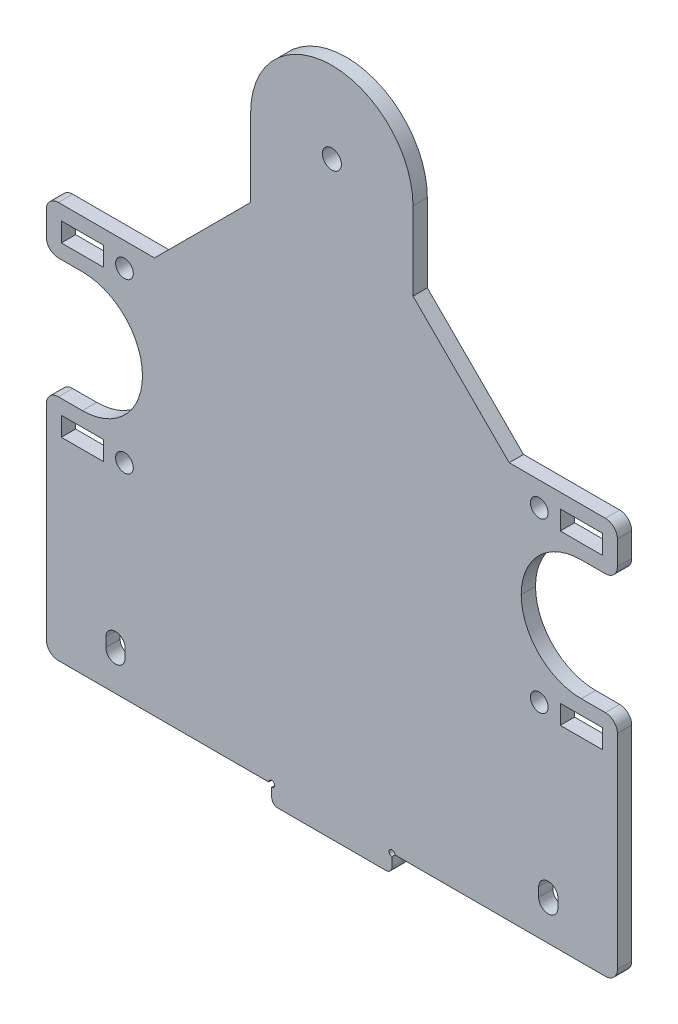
ISO-10303-21;
HEADER;
FILE_DESCRIPTION(('STEP AP214'),'2;1');
FILE_NAME('part.step','',(''),(''),'','','');
FILE_SCHEMA(('AUTOMOTIVE_DESIGN { 1 0 10303 214 1 1 1 1 }'));
ENDSEC;
DATA;
#1=APPLICATION_CONTEXT('core data for automotive mechanical design processes');
#2=APPLICATION_PROTOCOL_DEFINITION('international standard','automotive_design',2000,#1);
#3=PRODUCT_CONTEXT('',#1,'mechanical');
#4=PRODUCT('Part','Part','',(#3));
#5=PRODUCT_RELATED_PRODUCT_CATEGORY('part','',(#4));
#6=PRODUCT_DEFINITION_FORMATION('','',#4);
#7=PRODUCT_DEFINITION_CONTEXT('part definition',#1,'design');
#8=PRODUCT_DEFINITION('design','',#6,#7);
#9=PRODUCT_DEFINITION_SHAPE('','',#8);
#10=(LENGTH_UNIT() NAMED_UNIT(*) SI_UNIT(.MILLI.,.METRE.));
#11=(NAMED_UNIT(*) PLANE_ANGLE_UNIT() SI_UNIT($,.RADIAN.));
#12=(NAMED_UNIT(*) SI_UNIT($,.STERADIAN.) SOLID_ANGLE_UNIT());
#13=UNCERTAINTY_MEASURE_WITH_UNIT(LENGTH_MEASURE(1.E-05),#10,'distance_accuracy_value','');
#14=(GEOMETRIC_REPRESENTATION_CONTEXT(3) GLOBAL_UNCERTAINTY_ASSIGNED_CONTEXT((#13)) GLOBAL_UNIT_ASSIGNED_CONTEXT((#10,
#11,#12)) REPRESENTATION_CONTEXT('',''));
#15=CARTESIAN_POINT('',(0.,0.,0.));
#16=DIRECTION('',(0.,0.,1.));
#17=DIRECTION('',(1.,0.,0.));
#18=AXIS2_PLACEMENT_3D('',#15,#16,#17);
#19=CARTESIAN_POINT('',(47.5,-95.,110.292807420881));
#20=DIRECTION('',(0.,-1.,0.));
#21=DIRECTION('',(0.,0.,-1.));
#22=AXIS2_PLACEMENT_3D('',#19,#20,#21);
#23=PLANE('',#22);
#24=DIRECTION('',(0.,0.,-1.));
#25=VECTOR('',#24,1.);
#26=CARTESIAN_POINT('',(10.5,-95.,2.38225));
#27=LINE('',#26,#25);
#28=CARTESIAN_POINT('',(10.5,-95.,2.38125));
#29=VERTEX_POINT('',#28);
#30=CARTESIAN_POINT('',(10.5,-95.,0.));
#31=VERTEX_POINT('',#30);
#32=EDGE_CURVE('E412',#29,#31,#27,.T.);
#33=ORIENTED_EDGE('',*,*,#32,.T.);
#34=DIRECTION('',(-1.,0.,0.));
#35=VECTOR('',#34,1.);
#36=CARTESIAN_POINT('',(47.5,-95.,0.));
#37=LINE('',#36,#35);
#38=CARTESIAN_POINT('',(45.5,-95.,0.));
#39=VERTEX_POINT('',#38);
#40=EDGE_CURVE('E421',#39,#31,#37,.T.);
#41=ORIENTED_EDGE('',*,*,#40,.F.);
#42=DIRECTION('',(0.,0.,-1.));
#43=VECTOR('',#42,1.);
#44=CARTESIAN_POINT('',(45.5,-95.,2.38125));
#45=LINE('',#44,#43);
#46=CARTESIAN_POINT('',(45.5,-95.,2.38125));
#47=VERTEX_POINT('',#46);
#48=EDGE_CURVE('E746',#39,#47,#45,.F.);
#49=ORIENTED_EDGE('',*,*,#48,.T.);
#50=DIRECTION('',(-1.,0.,0.));
#51=VECTOR('',#50,1.);
#52=CARTESIAN_POINT('',(47.5,-95.,2.38125));
#53=LINE('',#52,#51);
#54=EDGE_CURVE('E424',#47,#29,#53,.T.);
#55=ORIENTED_EDGE('',*,*,#54,.T.);
#56=EDGE_LOOP('',(#33,#41,#49,#55));
#57=FACE_BOUND('',#56,.T.);
#58=ADVANCED_FACE('F34',(#57),#23,.T.);
#59=CARTESIAN_POINT('',(0.,0.,2.38125));
#60=DIRECTION('',(0.,0.,1.));
#61=DIRECTION('',(1.,0.,0.));
#62=AXIS2_PLACEMENT_3D('',#59,#60,#61);
#63=PLANE('',#62);
#64=CARTESIAN_POINT('',(10.,-95.,2.38125));
#65=DIRECTION('',(0.,0.,1.));
#66=DIRECTION('',(1.,0.,0.));
#67=AXIS2_PLACEMENT_3D('',#64,#65,#66);
#68=CIRCLE('',#67,0.500000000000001);
#69=CARTESIAN_POINT('',(10.,-95.5,2.38125));
#70=VERTEX_POINT('',#69);
#71=EDGE_CURVE('E49',#70,#29,#68,.F.);
#72=ORIENTED_EDGE('',*,*,#71,.T.);
#73=ORIENTED_EDGE('',*,*,#54,.F.);
#74=CARTESIAN_POINT('',(45.5,-93.,2.38125));
#75=DIRECTION('',(0.,0.,1.));
#76=DIRECTION('',(1.,0.,0.));
#77=AXIS2_PLACEMENT_3D('',#74,#75,#76);
#78=CIRCLE('',#77,2.);
#79=CARTESIAN_POINT('',(47.5,-93.,2.38125));
#80=VERTEX_POINT('',#79);
#81=EDGE_CURVE('E763',#47,#80,#78,.T.);
#82=ORIENTED_EDGE('',*,*,#81,.T.);
#83=DIRECTION('',(0.,1.,0.));
#84=VECTOR('',#83,1.);
#85=CARTESIAN_POINT('',(47.5,-57.,2.38125));
#86=LINE('',#85,#84);
#87=CARTESIAN_POINT('',(47.5,-59.,2.38125));
#88=VERTEX_POINT('',#87);
#89=EDGE_CURVE('E617',#80,#88,#86,.T.);
#90=ORIENTED_EDGE('',*,*,#89,.T.);
#91=CARTESIAN_POINT('',(45.5,-59.,2.38125));
#92=DIRECTION('',(0.,0.,1.));
#93=DIRECTION('',(1.,0.,0.));
#94=AXIS2_PLACEMENT_3D('',#91,#92,#93);
#95=CIRCLE('',#94,2.);
#96=CARTESIAN_POINT('',(45.5,-57.,2.38125));
#97=VERTEX_POINT('',#96);
#98=EDGE_CURVE('E752',#88,#97,#95,.T.);
#99=ORIENTED_EDGE('',*,*,#98,.T.);
#100=DIRECTION('',(-1.,0.,0.));
#101=VECTOR('',#100,1.);
#102=CARTESIAN_POINT('',(31.5,-57.,2.38125));
#103=LINE('',#102,#101);
#104=CARTESIAN_POINT('',(41.5000000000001,-57.,2.38125));
#105=VERTEX_POINT('',#104);
#106=EDGE_CURVE('E620',#97,#105,#103,.T.);
#107=ORIENTED_EDGE('',*,*,#106,.T.);
#108=CARTESIAN_POINT('',(41.5000000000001,-47.,2.38125));
#109=DIRECTION('',(0.,0.,1.));
#110=DIRECTION('',(1.,0.,0.));
#111=AXIS2_PLACEMENT_3D('',#108,#109,#110);
#112=CIRCLE('',#111,10.);
#113=CARTESIAN_POINT('',(31.5000000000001,-47.,2.38125));
#114=VERTEX_POINT('',#113);
#115=EDGE_CURVE('E713',#105,#114,#112,.F.);
#116=ORIENTED_EDGE('',*,*,#115,.T.);
#117=CARTESIAN_POINT('',(41.5000000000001,-47.,2.38125));
#118=DIRECTION('',(0.,0.,1.));
#119=DIRECTION('',(1.,0.,0.));
#120=AXIS2_PLACEMENT_3D('',#117,#118,#119);
#121=CIRCLE('',#120,10.);
#122=CARTESIAN_POINT('',(41.5000000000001,-37.,2.38125));
#123=VERTEX_POINT('',#122);
#124=EDGE_CURVE('E717',#114,#123,#121,.F.);
#125=ORIENTED_EDGE('',*,*,#124,.T.);
#126=DIRECTION('',(1.,0.,0.));
#127=VECTOR('',#126,1.);
#128=CARTESIAN_POINT('',(47.5000000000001,-37.,2.38125));
#129=LINE('',#128,#127);
#130=CARTESIAN_POINT('',(45.5000000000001,-37.,2.38125));
#131=VERTEX_POINT('',#130);
#132=EDGE_CURVE('E622',#123,#131,#129,.T.);
#133=ORIENTED_EDGE('',*,*,#132,.T.);
#134=CARTESIAN_POINT('',(45.5000000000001,-35.,2.38125));
#135=DIRECTION('',(0.,0.,1.));
#136=DIRECTION('',(1.,0.,0.));
#137=AXIS2_PLACEMENT_3D('',#134,#135,#136);
#138=CIRCLE('',#137,2.);
#139=CARTESIAN_POINT('',(47.5000000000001,-35.,2.38125));
#140=VERTEX_POINT('',#139);
#141=EDGE_CURVE('E750',#131,#140,#138,.T.);
#142=ORIENTED_EDGE('',*,*,#141,.T.);
#143=DIRECTION('',(0.,1.,0.));
#144=VECTOR('',#143,1.);
#145=CARTESIAN_POINT('',(47.5,-29.,2.38125));
#146=LINE('',#145,#144);
#147=CARTESIAN_POINT('',(47.5,-31.,2.38125));
#148=VERTEX_POINT('',#147);
#149=EDGE_CURVE('E625',#140,#148,#146,.T.);
#150=ORIENTED_EDGE('',*,*,#149,.T.);
#151=CARTESIAN_POINT('',(45.5,-31.,2.38125));
#152=DIRECTION('',(0.,0.,1.));
#153=DIRECTION('',(1.,0.,0.));
#154=AXIS2_PLACEMENT_3D('',#151,#152,#153);
#155=CIRCLE('',#154,2.);
#156=CARTESIAN_POINT('',(45.5,-29.,2.38125));
#157=VERTEX_POINT('',#156);
#158=EDGE_CURVE('E748',#148,#157,#155,.T.);
#159=ORIENTED_EDGE('',*,*,#158,.T.);
#160=DIRECTION('',(-1.,0.,0.));
#161=VECTOR('',#160,1.);
#162=CARTESIAN_POINT('',(13.5,-29.,2.38125));
#163=LINE('',#162,#161);
#164=CARTESIAN_POINT('',(29.5,-29.,2.38125));
#165=VERTEX_POINT('',#164);
#166=EDGE_CURVE('E628',#157,#165,#163,.T.);
#167=ORIENTED_EDGE('',*,*,#166,.T.);
#168=DIRECTION('',(0.707106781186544,-0.707106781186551,0.));
#169=VECTOR('',#168,1.);
#170=CARTESIAN_POINT('',(13.5,-12.9999999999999,2.38125));
#171=LINE('',#170,#169);
#172=CARTESIAN_POINT('',(13.5,-12.9999999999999,2.38125));
#173=VERTEX_POINT('',#172);
#174=EDGE_CURVE('E685',#165,#173,#171,.F.);
#175=ORIENTED_EDGE('',*,*,#174,.T.);
#176=DIRECTION('',(0.,1.,0.));
#177=VECTOR('',#176,1.);
#178=CARTESIAN_POINT('',(13.5,0.,2.38125));
#179=LINE('',#178,#177);
#180=CARTESIAN_POINT('',(13.5,0.,2.38125));
#181=VERTEX_POINT('',#180);
#182=EDGE_CURVE('E630',#173,#181,#179,.T.);
#183=ORIENTED_EDGE('',*,*,#182,.T.);
#184=CARTESIAN_POINT('',(0.,0.,2.38125));
#185=DIRECTION('',(0.,0.,1.));
#186=DIRECTION('',(1.,0.,0.));
#187=AXIS2_PLACEMENT_3D('',#184,#185,#186);
#188=CIRCLE('',#187,13.5);
#189=CARTESIAN_POINT('',(-13.5,0.,2.38125));
#190=VERTEX_POINT('',#189);
#191=EDGE_CURVE('E596',#181,#190,#188,.T.);
#192=ORIENTED_EDGE('',*,*,#191,.T.);
#193=DIRECTION('',(0.,-1.,0.));
#194=VECTOR('',#193,1.);
#195=CARTESIAN_POINT('',(-13.5,0.,2.38125));
#196=LINE('',#195,#194);
#197=CARTESIAN_POINT('',(-13.5,-13.0000000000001,2.38125));
#198=VERTEX_POINT('',#197);
#199=EDGE_CURVE('E599',#190,#198,#196,.T.);
#200=ORIENTED_EDGE('',*,*,#199,.T.);
#201=DIRECTION('',(0.707106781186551,0.707106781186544,0.));
#202=VECTOR('',#201,1.);
#203=CARTESIAN_POINT('',(-29.5000000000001,-29.,2.38125));
#204=LINE('',#203,#202);
#205=CARTESIAN_POINT('',(-29.5000000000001,-29.,2.38125));
#206=VERTEX_POINT('',#205);
#207=EDGE_CURVE('E689',#198,#206,#204,.F.);
#208=ORIENTED_EDGE('',*,*,#207,.T.);
#209=DIRECTION('',(-1.,0.,0.));
#210=VECTOR('',#209,1.);
#211=CARTESIAN_POINT('',(-13.5,-29.,2.38125));
#212=LINE('',#211,#210);
#213=CARTESIAN_POINT('',(-45.5,-29.,2.38125));
#214=VERTEX_POINT('',#213);
#215=EDGE_CURVE('E603',#206,#214,#212,.T.);
#216=ORIENTED_EDGE('',*,*,#215,.T.);
#217=CARTESIAN_POINT('',(-45.5,-31.,2.38125));
#218=DIRECTION('',(0.,0.,1.));
#219=DIRECTION('',(1.,0.,0.));
#220=AXIS2_PLACEMENT_3D('',#217,#218,#219);
#221=CIRCLE('',#220,2.);
#222=CARTESIAN_POINT('',(-47.5,-31.,2.38125));
#223=VERTEX_POINT('',#222);
#224=EDGE_CURVE('E754',#214,#223,#221,.T.);
#225=ORIENTED_EDGE('',*,*,#224,.T.);
#226=DIRECTION('',(0.,-1.,0.));
#227=VECTOR('',#226,1.);
#228=CARTESIAN_POINT('',(-47.5,-29.,2.38125));
#229=LINE('',#228,#227);
#230=CARTESIAN_POINT('',(-47.5,-35.,2.38125));
#231=VERTEX_POINT('',#230);
#232=EDGE_CURVE('E606',#223,#231,#229,.T.);
#233=ORIENTED_EDGE('',*,*,#232,.T.);
#234=CARTESIAN_POINT('',(-45.5,-35.,2.38125));
#235=DIRECTION('',(0.,0.,1.));
#236=DIRECTION('',(1.,0.,0.));
#237=AXIS2_PLACEMENT_3D('',#234,#235,#236);
#238=CIRCLE('',#237,2.);
#239=CARTESIAN_POINT('',(-45.5,-37.,2.38125));
#240=VERTEX_POINT('',#239);
#241=EDGE_CURVE('E756',#231,#240,#238,.T.);
#242=ORIENTED_EDGE('',*,*,#241,.T.);
#243=DIRECTION('',(1.,0.,0.));
#244=VECTOR('',#243,1.);
#245=CARTESIAN_POINT('',(-47.5,-37.,2.38125));
#246=LINE('',#245,#244);
#247=CARTESIAN_POINT('',(-41.5,-37.,2.38125));
#248=VERTEX_POINT('',#247);
#249=EDGE_CURVE('E609',#240,#248,#246,.T.);
#250=ORIENTED_EDGE('',*,*,#249,.T.);
#251=CARTESIAN_POINT('',(-41.5,-47.,2.38125));
#252=DIRECTION('',(0.,0.,1.));
#253=DIRECTION('',(1.,0.,0.));
#254=AXIS2_PLACEMENT_3D('',#251,#252,#253);
#255=CIRCLE('',#254,10.);
#256=CARTESIAN_POINT('',(-31.5,-47.,2.38125));
#257=VERTEX_POINT('',#256);
#258=EDGE_CURVE('E704',#248,#257,#255,.F.);
#259=ORIENTED_EDGE('',*,*,#258,.T.);
#260=CARTESIAN_POINT('',(-41.5,-47.,2.38125));
#261=DIRECTION('',(0.,0.,1.));
#262=DIRECTION('',(1.,0.,0.));
#263=AXIS2_PLACEMENT_3D('',#260,#261,#262);
#264=CIRCLE('',#263,10.);
#265=CARTESIAN_POINT('',(-41.5,-57.,2.38125));
#266=VERTEX_POINT('',#265);
#267=EDGE_CURVE('E708',#257,#266,#264,.F.);
#268=ORIENTED_EDGE('',*,*,#267,.T.);
#269=DIRECTION('',(-1.,0.,0.));
#270=VECTOR('',#269,1.);
#271=CARTESIAN_POINT('',(-31.5,-57.,2.38125));
#272=LINE('',#271,#270);
#273=CARTESIAN_POINT('',(-45.5,-57.,2.38125));
#274=VERTEX_POINT('',#273);
#275=EDGE_CURVE('E611',#266,#274,#272,.T.);
#276=ORIENTED_EDGE('',*,*,#275,.T.);
#277=CARTESIAN_POINT('',(-45.5,-59.,2.38125));
#278=DIRECTION('',(0.,0.,1.));
#279=DIRECTION('',(1.,0.,0.));
#280=AXIS2_PLACEMENT_3D('',#277,#278,#279);
#281=CIRCLE('',#280,2.);
#282=CARTESIAN_POINT('',(-47.5,-59.,2.38125));
#283=VERTEX_POINT('',#282);
#284=EDGE_CURVE('E758',#274,#283,#281,.T.);
#285=ORIENTED_EDGE('',*,*,#284,.T.);
#286=DIRECTION('',(0.,-1.,0.));
#287=VECTOR('',#286,1.);
#288=CARTESIAN_POINT('',(-47.5,-57.,2.38125));
#289=LINE('',#288,#287);
#290=CARTESIAN_POINT('',(-47.5,-93.,2.38125));
#291=VERTEX_POINT('',#290);
#292=EDGE_CURVE('E614',#283,#291,#289,.T.);
#293=ORIENTED_EDGE('',*,*,#292,.T.);
#294=CARTESIAN_POINT('',(-45.5,-93.,2.38125));
#295=DIRECTION('',(0.,0.,1.));
#296=DIRECTION('',(1.,0.,0.));
#297=AXIS2_PLACEMENT_3D('',#294,#295,#296);
#298=CIRCLE('',#297,2.);
#299=CARTESIAN_POINT('',(-45.5,-95.,2.38125));
#300=VERTEX_POINT('',#299);
#301=EDGE_CURVE('E760',#291,#300,#298,.T.);
#302=ORIENTED_EDGE('',*,*,#301,.T.);
#303=CARTESIAN_POINT('',(-10.5,-95.,2.38125));
#304=VERTEX_POINT('',#303);
#305=EDGE_CURVE('E430',#304,#300,#53,.T.);
#306=ORIENTED_EDGE('',*,*,#305,.F.);
#307=CARTESIAN_POINT('',(-10.,-95.,2.38125));
#308=DIRECTION('',(0.,0.,1.));
#309=DIRECTION('',(1.,0.,0.));
#310=AXIS2_PLACEMENT_3D('',#307,#308,#309);
#311=CIRCLE('',#310,0.500000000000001);
#312=CARTESIAN_POINT('',(-10.,-95.5,2.38125));
#313=VERTEX_POINT('',#312);
#314=EDGE_CURVE('E964',#304,#313,#311,.F.);
#315=ORIENTED_EDGE('',*,*,#314,.T.);
#316=DIRECTION('',(0.,1.,0.));
#317=VECTOR('',#316,1.);
#318=CARTESIAN_POINT('',(-10.,-95.,2.38125));
#319=LINE('',#318,#317);
#320=CARTESIAN_POINT('',(-10.,-97.,2.38125));
#321=VERTEX_POINT('',#320);
#322=EDGE_CURVE('E819',#321,#313,#319,.T.);
#323=ORIENTED_EDGE('',*,*,#322,.F.);
#324=CARTESIAN_POINT('',(-9.00000000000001,-97.,2.38125));
#325=DIRECTION('',(0.,0.,1.));
#326=DIRECTION('',(1.,0.,0.));
#327=AXIS2_PLACEMENT_3D('',#324,#325,#326);
#328=CIRCLE('',#327,1.);
#329=CARTESIAN_POINT('',(-9.00000000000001,-98.,2.38125));
#330=VERTEX_POINT('',#329);
#331=EDGE_CURVE('E42',#321,#330,#328,.T.);
#332=ORIENTED_EDGE('',*,*,#331,.T.);
#333=DIRECTION('',(-1.,0.,0.));
#334=VECTOR('',#333,1.);
#335=CARTESIAN_POINT('',(-10.,-98.,2.38125));
#336=LINE('',#335,#334);
#337=CARTESIAN_POINT('',(8.99999999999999,-98.,2.38125));
#338=VERTEX_POINT('',#337);
#339=EDGE_CURVE('E815',#338,#330,#336,.T.);
#340=ORIENTED_EDGE('',*,*,#339,.F.);
#341=CARTESIAN_POINT('',(8.99999999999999,-97.,2.38125));
#342=DIRECTION('',(0.,0.,1.));
#343=DIRECTION('',(1.,0.,0.));
#344=AXIS2_PLACEMENT_3D('',#341,#342,#343);
#345=CIRCLE('',#344,1.);
#346=CARTESIAN_POINT('',(9.99999999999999,-97.,2.38125));
#347=VERTEX_POINT('',#346);
#348=EDGE_CURVE('E806',#338,#347,#345,.T.);
#349=ORIENTED_EDGE('',*,*,#348,.T.);
#350=DIRECTION('',(0.,-1.,0.));
#351=VECTOR('',#350,1.);
#352=CARTESIAN_POINT('',(10.,-95.,2.38125));
#353=LINE('',#352,#351);
#354=EDGE_CURVE('E828',#70,#347,#353,.T.);
#355=ORIENTED_EDGE('',*,*,#354,.F.);
#356=EDGE_LOOP('',(#72,#73,#82,#90,#99,#107,#116,#125,#133,#142,#150,#159,#167,#175,#183,#192,
#200,#208,#216,#225,#233,#242,#250,#259,#268,#276,#285,#293,#302,#306,#315,#323,#332,#340,#349,#355));
#357=FACE_BOUND('',#356,.T.);
#358=CARTESIAN_POINT('',(-36.,-89.15,2.38125));
#359=DIRECTION('',(0.,0.,-1.));
#360=DIRECTION('',(-1.,0.,0.));
#361=AXIS2_PLACEMENT_3D('',#358,#359,#360);
#362=CIRCLE('',#361,1.60000000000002);
#363=CARTESIAN_POINT('',(-34.4,-89.15,2.38125));
#364=VERTEX_POINT('',#363);
#365=CARTESIAN_POINT('',(-37.6,-89.15,2.38125));
#366=VERTEX_POINT('',#365);
#367=EDGE_CURVE('E847',#364,#366,#362,.T.);
#368=ORIENTED_EDGE('',*,*,#367,.T.);
#369=DIRECTION('',(0.,1.,0.));
#370=VECTOR('',#369,1.);
#371=CARTESIAN_POINT('',(-37.6,-89.15,2.38125));
#372=LINE('',#371,#370);
#373=CARTESIAN_POINT('',(-37.6,-87.65,2.38125));
#374=VERTEX_POINT('',#373);
#375=EDGE_CURVE('E850',#366,#374,#372,.T.);
#376=ORIENTED_EDGE('',*,*,#375,.T.);
#377=CARTESIAN_POINT('',(-36.,-87.65,2.38125));
#378=DIRECTION('',(0.,0.,-1.));
#379=DIRECTION('',(-1.,0.,0.));
#380=AXIS2_PLACEMENT_3D('',#377,#378,#379);
#381=CIRCLE('',#380,1.60000000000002);
#382=CARTESIAN_POINT('',(-34.4,-87.65,2.38125));
#383=VERTEX_POINT('',#382);
#384=EDGE_CURVE('E854',#374,#383,#381,.T.);
#385=ORIENTED_EDGE('',*,*,#384,.T.);
#386=DIRECTION('',(0.,-1.,0.));
#387=VECTOR('',#386,1.);
#388=CARTESIAN_POINT('',(-34.4,-89.15,2.38125));
#389=LINE('',#388,#387);
#390=EDGE_CURVE('E857',#383,#364,#389,.T.);
#391=ORIENTED_EDGE('',*,*,#390,.T.);
#392=EDGE_LOOP('',(#368,#376,#385,#391));
#393=FACE_BOUND('',#392,.T.);
#394=CARTESIAN_POINT('',(36.,-89.15,2.38125));
#395=DIRECTION('',(0.,0.,-1.));
#396=DIRECTION('',(1.,0.,0.));
#397=AXIS2_PLACEMENT_3D('',#394,#395,#396);
#398=CIRCLE('',#397,1.60000000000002);
#399=CARTESIAN_POINT('',(37.6,-89.15,2.38125));
#400=VERTEX_POINT('',#399);
#401=CARTESIAN_POINT('',(34.4,-89.15,2.38125));
#402=VERTEX_POINT('',#401);
#403=EDGE_CURVE('E879',#400,#402,#398,.T.);
#404=ORIENTED_EDGE('',*,*,#403,.T.);
#405=DIRECTION('',(0.,1.,0.));
#406=VECTOR('',#405,1.);
#407=CARTESIAN_POINT('',(34.4,-89.15,2.38125));
#408=LINE('',#407,#406);
#409=CARTESIAN_POINT('',(34.4,-87.65,2.38125));
#410=VERTEX_POINT('',#409);
#411=EDGE_CURVE('E882',#402,#410,#408,.T.);
#412=ORIENTED_EDGE('',*,*,#411,.T.);
#413=CARTESIAN_POINT('',(36.,-87.65,2.38125));
#414=DIRECTION('',(0.,0.,-1.));
#415=DIRECTION('',(1.,0.,0.));
#416=AXIS2_PLACEMENT_3D('',#413,#414,#415);
#417=CIRCLE('',#416,1.60000000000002);
#418=CARTESIAN_POINT('',(37.6,-87.65,2.38125));
#419=VERTEX_POINT('',#418);
#420=EDGE_CURVE('E886',#410,#419,#417,.T.);
#421=ORIENTED_EDGE('',*,*,#420,.T.);
#422=DIRECTION('',(0.,-1.,0.));
#423=VECTOR('',#422,1.);
#424=CARTESIAN_POINT('',(37.6,-89.15,2.38125));
#425=LINE('',#424,#423);
#426=EDGE_CURVE('E889',#419,#400,#425,.T.);
#427=ORIENTED_EDGE('',*,*,#426,.T.);
#428=EDGE_LOOP('',(#404,#412,#421,#427));
#429=FACE_BOUND('',#428,.T.);
#430=CARTESIAN_POINT('',(34.5,-33.,2.38125));
#431=DIRECTION('',(0.,0.,1.));
#432=DIRECTION('',(1.,0.,0.));
#433=AXIS2_PLACEMENT_3D('',#430,#431,#432);
#434=CIRCLE('',#433,1.4732);
#435=CARTESIAN_POINT('',(33.0268,-33.,2.38125));
#436=VERTEX_POINT('',#435);
#437=EDGE_CURVE('E448',#436,#436,#434,.T.);
#438=ORIENTED_EDGE('',*,*,#437,.F.);
#439=EDGE_LOOP('',(#438));
#440=FACE_BOUND('',#439,.T.);
#441=CARTESIAN_POINT('',(-34.5,-61.,2.38125));
#442=DIRECTION('',(0.,0.,1.));
#443=DIRECTION('',(1.,0.,0.));
#444=AXIS2_PLACEMENT_3D('',#441,#442,#443);
#445=CIRCLE('',#444,1.4732);
#446=CARTESIAN_POINT('',(-35.9731999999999,-61.,2.38125));
#447=VERTEX_POINT('',#446);
#448=EDGE_CURVE('E460',#447,#447,#445,.T.);
#449=ORIENTED_EDGE('',*,*,#448,.F.);
#450=EDGE_LOOP('',(#449));
#451=FACE_BOUND('',#450,.T.);
#452=CARTESIAN_POINT('',(0.,0.,2.38125));
#453=DIRECTION('',(0.,0.,1.));
#454=DIRECTION('',(1.,0.,0.));
#455=AXIS2_PLACEMENT_3D('',#452,#453,#454);
#456=CIRCLE('',#455,1.5875);
#457=CARTESIAN_POINT('',(-1.58749999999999,0.,2.38125));
#458=VERTEX_POINT('',#457);
#459=EDGE_CURVE('E590',#458,#458,#456,.T.);
#460=ORIENTED_EDGE('',*,*,#459,.F.);
#461=EDGE_LOOP('',(#460));
#462=FACE_BOUND('',#461,.T.);
#463=DIRECTION('',(0.,-1.,0.));
#464=VECTOR('',#463,1.);
#465=CARTESIAN_POINT('',(-44.9999999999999,-59.4125,2.38125));
#466=LINE('',#465,#464);
#467=CARTESIAN_POINT('',(-44.9999999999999,-59.4125,2.38125));
#468=VERTEX_POINT('',#467);
#469=CARTESIAN_POINT('',(-44.9999999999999,-62.5875,2.38125));
#470=VERTEX_POINT('',#469);
#471=EDGE_CURVE('E561',#468,#470,#466,.T.);
#472=ORIENTED_EDGE('',*,*,#471,.F.);
#473=DIRECTION('',(-1.,0.,0.));
#474=VECTOR('',#473,1.);
#475=CARTESIAN_POINT('',(-44.9999999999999,-59.4125,2.38125));
#476=LINE('',#475,#474);
#477=CARTESIAN_POINT('',(-37.9999999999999,-59.4125,2.38125));
#478=VERTEX_POINT('',#477);
#479=EDGE_CURVE('E559',#478,#468,#476,.T.);
#480=ORIENTED_EDGE('',*,*,#479,.F.);
#481=DIRECTION('',(0.,1.,0.));
#482=VECTOR('',#481,1.);
#483=CARTESIAN_POINT('',(-37.9999999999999,-59.4125,2.38125));
#484=LINE('',#483,#482);
#485=CARTESIAN_POINT('',(-38.,-62.5875,2.38125));
#486=VERTEX_POINT('',#485);
#487=EDGE_CURVE('E567',#486,#478,#484,.T.);
#488=ORIENTED_EDGE('',*,*,#487,.F.);
#489=DIRECTION('',(1.,0.,0.));
#490=VECTOR('',#489,1.);
#491=CARTESIAN_POINT('',(-44.9999999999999,-62.5875,2.38125));
#492=LINE('',#491,#490);
#493=EDGE_CURVE('E564',#470,#486,#492,.T.);
#494=ORIENTED_EDGE('',*,*,#493,.F.);
#495=EDGE_LOOP('',(#472,#480,#488,#494));
#496=FACE_BOUND('',#495,.T.);
#497=DIRECTION('',(0.,-1.,0.));
#498=VECTOR('',#497,1.);
#499=CARTESIAN_POINT('',(38.,-59.4125,2.38125));
#500=LINE('',#499,#498);
#501=CARTESIAN_POINT('',(38.,-59.4125,2.38125));
#502=VERTEX_POINT('',#501);
#503=CARTESIAN_POINT('',(38.,-62.5875,2.38125));
#504=VERTEX_POINT('',#503);
#505=EDGE_CURVE('E530',#502,#504,#500,.T.);
#506=ORIENTED_EDGE('',*,*,#505,.F.);
#507=DIRECTION('',(-1.,0.,0.));
#508=VECTOR('',#507,1.);
#509=CARTESIAN_POINT('',(45.,-59.4125,2.38125));
#510=LINE('',#509,#508);
#511=CARTESIAN_POINT('',(45.,-59.4125,2.38125));
#512=VERTEX_POINT('',#511);
#513=EDGE_CURVE('E528',#512,#502,#510,.T.);
#514=ORIENTED_EDGE('',*,*,#513,.F.);
#515=DIRECTION('',(0.,1.,0.));
#516=VECTOR('',#515,1.);
#517=CARTESIAN_POINT('',(45.,-59.4125,2.38125));
#518=LINE('',#517,#516);
#519=CARTESIAN_POINT('',(45.,-62.5875,2.38125));
#520=VERTEX_POINT('',#519);
#521=EDGE_CURVE('E536',#520,#512,#518,.T.);
#522=ORIENTED_EDGE('',*,*,#521,.F.);
#523=DIRECTION('',(1.,0.,0.));
#524=VECTOR('',#523,1.);
#525=CARTESIAN_POINT('',(45.,-62.5875,2.38125));
#526=LINE('',#525,#524);
#527=EDGE_CURVE('E533',#504,#520,#526,.T.);
#528=ORIENTED_EDGE('',*,*,#527,.F.);
#529=EDGE_LOOP('',(#506,#514,#522,#528));
#530=FACE_BOUND('',#529,.T.);
#531=DIRECTION('',(0.,1.,0.));
#532=VECTOR('',#531,1.);
#533=CARTESIAN_POINT('',(45.,-34.5875,2.38125));
#534=LINE('',#533,#532);
#535=CARTESIAN_POINT('',(45.,-34.5875,2.38125));
#536=VERTEX_POINT('',#535);
#537=CARTESIAN_POINT('',(45.,-31.4125,2.38125));
#538=VERTEX_POINT('',#537);
#539=EDGE_CURVE('E499',#536,#538,#534,.T.);
#540=ORIENTED_EDGE('',*,*,#539,.F.);
#541=DIRECTION('',(1.,0.,0.));
#542=VECTOR('',#541,1.);
#543=CARTESIAN_POINT('',(45.,-34.5875,2.38125));
#544=LINE('',#543,#542);
#545=CARTESIAN_POINT('',(38.,-34.5875,2.38125));
#546=VERTEX_POINT('',#545);
#547=EDGE_CURVE('E497',#546,#536,#544,.T.);
#548=ORIENTED_EDGE('',*,*,#547,.F.);
#549=DIRECTION('',(0.,-1.,0.));
#550=VECTOR('',#549,1.);
#551=CARTESIAN_POINT('',(38.,-34.5875,2.38125));
#552=LINE('',#551,#550);
#553=CARTESIAN_POINT('',(38.,-31.4125,2.38125));
#554=VERTEX_POINT('',#553);
#555=EDGE_CURVE('E505',#554,#546,#552,.T.);
#556=ORIENTED_EDGE('',*,*,#555,.F.);
#557=DIRECTION('',(-1.,0.,0.));
#558=VECTOR('',#557,1.);
#559=CARTESIAN_POINT('',(45.,-31.4125,2.38125));
#560=LINE('',#559,#558);
#561=EDGE_CURVE('E502',#538,#554,#560,.T.);
#562=ORIENTED_EDGE('',*,*,#561,.F.);
#563=EDGE_LOOP('',(#540,#548,#556,#562));
#564=FACE_BOUND('',#563,.T.);
#565=DIRECTION('',(0.,1.,0.));
#566=VECTOR('',#565,1.);
#567=CARTESIAN_POINT('',(-37.9999999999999,-34.5875,2.38125));
#568=LINE('',#567,#566);
#569=CARTESIAN_POINT('',(-37.9999999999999,-34.5875,2.38125));
#570=VERTEX_POINT('',#569);
#571=CARTESIAN_POINT('',(-38.,-31.4125,2.38125));
#572=VERTEX_POINT('',#571);
#573=EDGE_CURVE('E468',#570,#572,#568,.T.);
#574=ORIENTED_EDGE('',*,*,#573,.F.);
#575=DIRECTION('',(1.,0.,0.));
#576=VECTOR('',#575,1.);
#577=CARTESIAN_POINT('',(-44.9999999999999,-34.5875,2.38125));
#578=LINE('',#577,#576);
#579=CARTESIAN_POINT('',(-44.9999999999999,-34.5875,2.38125));
#580=VERTEX_POINT('',#579);
#581=EDGE_CURVE('E466',#580,#570,#578,.T.);
#582=ORIENTED_EDGE('',*,*,#581,.F.);
#583=DIRECTION('',(0.,-1.,0.));
#584=VECTOR('',#583,1.);
#585=CARTESIAN_POINT('',(-44.9999999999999,-34.5875,2.38125));
#586=LINE('',#585,#584);
#587=CARTESIAN_POINT('',(-44.9999999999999,-31.4125,2.38125));
#588=VERTEX_POINT('',#587);
#589=EDGE_CURVE('E474',#588,#580,#586,.T.);
#590=ORIENTED_EDGE('',*,*,#589,.F.);
#591=DIRECTION('',(-1.,0.,0.));
#592=VECTOR('',#591,1.);
#593=CARTESIAN_POINT('',(-44.9999999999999,-31.4125,2.38125));
#594=LINE('',#593,#592);
#595=EDGE_CURVE('E471',#572,#588,#594,.T.);
#596=ORIENTED_EDGE('',*,*,#595,.F.);
#597=EDGE_LOOP('',(#574,#582,#590,#596));
#598=FACE_BOUND('',#597,.T.);
#599=CARTESIAN_POINT('',(34.5,-61.,2.38125));
#600=DIRECTION('',(0.,0.,1.));
#601=DIRECTION('',(1.,0.,0.));
#602=AXIS2_PLACEMENT_3D('',#599,#600,#601);
#603=CIRCLE('',#602,1.4732);
#604=CARTESIAN_POINT('',(33.0268,-61.,2.38125));
#605=VERTEX_POINT('',#604);
#606=EDGE_CURVE('E454',#605,#605,#603,.T.);
#607=ORIENTED_EDGE('',*,*,#606,.F.);
#608=EDGE_LOOP('',(#607));
#609=FACE_BOUND('',#608,.T.);
#610=CARTESIAN_POINT('',(-34.5,-33.,2.38125));
#611=DIRECTION('',(0.,0.,1.));
#612=DIRECTION('',(1.,0.,0.));
#613=AXIS2_PLACEMENT_3D('',#610,#611,#612);
#614=CIRCLE('',#613,1.4732);
#615=CARTESIAN_POINT('',(-35.9731999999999,-33.,2.38125));
#616=VERTEX_POINT('',#615);
#617=EDGE_CURVE('E440',#616,#616,#614,.T.);
#618=ORIENTED_EDGE('',*,*,#617,.F.);
#619=EDGE_LOOP('',(#618));
#620=FACE_BOUND('',#619,.T.);
#621=ADVANCED_FACE('F813',(#357,#393,#429,#440,#451,#462,#496,#530,#564,#598,#609,#620),#63,.T.);
#622=CARTESIAN_POINT('',(0.,0.,0.));
#623=DIRECTION('',(0.,0.,1.));
#624=DIRECTION('',(1.,0.,0.));
#625=AXIS2_PLACEMENT_3D('',#622,#623,#624);
#626=PLANE('',#625);
#627=DIRECTION('',(0.,1.,0.));
#628=VECTOR('',#627,1.);
#629=CARTESIAN_POINT('',(-37.6,-89.15,0.));
#630=LINE('',#629,#628);
#631=CARTESIAN_POINT('',(-37.6,-89.15,0.));
#632=VERTEX_POINT('',#631);
#633=CARTESIAN_POINT('',(-37.6,-87.65,0.));
#634=VERTEX_POINT('',#633);
#635=EDGE_CURVE('E863',#632,#634,#630,.T.);
#636=ORIENTED_EDGE('',*,*,#635,.F.);
#637=CARTESIAN_POINT('',(-36.,-89.15,0.));
#638=DIRECTION('',(0.,0.,-1.));
#639=DIRECTION('',(-1.,0.,0.));
#640=AXIS2_PLACEMENT_3D('',#637,#638,#639);
#641=CIRCLE('',#640,1.60000000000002);
#642=CARTESIAN_POINT('',(-34.4,-89.15,0.));
#643=VERTEX_POINT('',#642);
#644=EDGE_CURVE('E861',#643,#632,#641,.T.);
#645=ORIENTED_EDGE('',*,*,#644,.F.);
#646=DIRECTION('',(0.,-1.,0.));
#647=VECTOR('',#646,1.);
#648=CARTESIAN_POINT('',(-34.4,-89.15,0.));
#649=LINE('',#648,#647);
#650=CARTESIAN_POINT('',(-34.4,-87.65,0.));
#651=VERTEX_POINT('',#650);
#652=EDGE_CURVE('E851',#651,#643,#649,.T.);
#653=ORIENTED_EDGE('',*,*,#652,.F.);
#654=CARTESIAN_POINT('',(-36.,-87.65,0.));
#655=DIRECTION('',(0.,0.,-1.));
#656=DIRECTION('',(-1.,0.,0.));
#657=AXIS2_PLACEMENT_3D('',#654,#655,#656);
#658=CIRCLE('',#657,1.60000000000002);
#659=EDGE_CURVE('E867',#634,#651,#658,.T.);
#660=ORIENTED_EDGE('',*,*,#659,.F.);
#661=EDGE_LOOP('',(#636,#645,#653,#660));
#662=FACE_BOUND('',#661,.T.);
#663=DIRECTION('',(0.,1.,0.));
#664=VECTOR('',#663,1.);
#665=CARTESIAN_POINT('',(34.4,-89.15,0.));
#666=LINE('',#665,#664);
#667=CARTESIAN_POINT('',(34.4,-89.15,0.));
#668=VERTEX_POINT('',#667);
#669=CARTESIAN_POINT('',(34.4,-87.65,0.));
#670=VERTEX_POINT('',#669);
#671=EDGE_CURVE('E893',#668,#670,#666,.T.);
#672=ORIENTED_EDGE('',*,*,#671,.F.);
#673=CARTESIAN_POINT('',(36.,-89.15,0.));
#674=DIRECTION('',(0.,0.,-1.));
#675=DIRECTION('',(1.,0.,0.));
#676=AXIS2_PLACEMENT_3D('',#673,#674,#675);
#677=CIRCLE('',#676,1.60000000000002);
#678=CARTESIAN_POINT('',(37.6,-89.15,0.));
#679=VERTEX_POINT('',#678);
#680=EDGE_CURVE('E844',#679,#668,#677,.T.);
#681=ORIENTED_EDGE('',*,*,#680,.F.);
#682=DIRECTION('',(0.,-1.,0.));
#683=VECTOR('',#682,1.);
#684=CARTESIAN_POINT('',(37.6,-89.15,0.));
#685=LINE('',#684,#683);
#686=CARTESIAN_POINT('',(37.6,-87.65,0.));
#687=VERTEX_POINT('',#686);
#688=EDGE_CURVE('E883',#687,#679,#685,.T.);
#689=ORIENTED_EDGE('',*,*,#688,.F.);
#690=CARTESIAN_POINT('',(36.,-87.65,0.));
#691=DIRECTION('',(0.,0.,-1.));
#692=DIRECTION('',(1.,0.,0.));
#693=AXIS2_PLACEMENT_3D('',#690,#691,#692);
#694=CIRCLE('',#693,1.60000000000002);
#695=EDGE_CURVE('E896',#670,#687,#694,.T.);
#696=ORIENTED_EDGE('',*,*,#695,.F.);
#697=EDGE_LOOP('',(#672,#681,#689,#696));
#698=FACE_BOUND('',#697,.T.);
#699=DIRECTION('',(1.,0.,0.));
#700=VECTOR('',#699,1.);
#701=CARTESIAN_POINT('',(45.,-34.5875,0.));
#702=LINE('',#701,#700);
#703=CARTESIAN_POINT('',(38.,-34.5875,0.));
#704=VERTEX_POINT('',#703);
#705=CARTESIAN_POINT('',(45.,-34.5875,0.));
#706=VERTEX_POINT('',#705);
#707=EDGE_CURVE('E496',#704,#706,#702,.T.);
#708=ORIENTED_EDGE('',*,*,#707,.T.);
#709=DIRECTION('',(0.,1.,0.));
#710=VECTOR('',#709,1.);
#711=CARTESIAN_POINT('',(45.,-34.5875,0.));
#712=LINE('',#711,#710);
#713=CARTESIAN_POINT('',(45.,-31.4125,0.));
#714=VERTEX_POINT('',#713);
#715=EDGE_CURVE('E510',#706,#714,#712,.T.);
#716=ORIENTED_EDGE('',*,*,#715,.T.);
#717=DIRECTION('',(-1.,0.,0.));
#718=VECTOR('',#717,1.);
#719=CARTESIAN_POINT('',(45.,-31.4125,0.));
#720=LINE('',#719,#718);
#721=CARTESIAN_POINT('',(38.,-31.4125,0.));
#722=VERTEX_POINT('',#721);
#723=EDGE_CURVE('E513',#714,#722,#720,.T.);
#724=ORIENTED_EDGE('',*,*,#723,.T.);
#725=DIRECTION('',(0.,-1.,0.));
#726=VECTOR('',#725,1.);
#727=CARTESIAN_POINT('',(38.,-34.5875,0.));
#728=LINE('',#727,#726);
#729=EDGE_CURVE('E500',#722,#704,#728,.T.);
#730=ORIENTED_EDGE('',*,*,#729,.T.);
#731=EDGE_LOOP('',(#708,#716,#724,#730));
#732=FACE_BOUND('',#731,.T.);
#733=DIRECTION('',(-1.,0.,0.));
#734=VECTOR('',#733,1.);
#735=CARTESIAN_POINT('',(-44.9999999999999,-59.4125,0.));
#736=LINE('',#735,#734);
#737=CARTESIAN_POINT('',(-37.9999999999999,-59.4125,0.));
#738=VERTEX_POINT('',#737);
#739=CARTESIAN_POINT('',(-44.9999999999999,-59.4125,0.));
#740=VERTEX_POINT('',#739);
#741=EDGE_CURVE('E558',#738,#740,#736,.T.);
#742=ORIENTED_EDGE('',*,*,#741,.T.);
#743=DIRECTION('',(0.,-1.,0.));
#744=VECTOR('',#743,1.);
#745=CARTESIAN_POINT('',(-44.9999999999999,-59.4125,0.));
#746=LINE('',#745,#744);
#747=CARTESIAN_POINT('',(-44.9999999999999,-62.5875,0.));
#748=VERTEX_POINT('',#747);
#749=EDGE_CURVE('E572',#740,#748,#746,.T.);
#750=ORIENTED_EDGE('',*,*,#749,.T.);
#751=DIRECTION('',(1.,0.,0.));
#752=VECTOR('',#751,1.);
#753=CARTESIAN_POINT('',(-44.9999999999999,-62.5875,0.));
#754=LINE('',#753,#752);
#755=CARTESIAN_POINT('',(-38.,-62.5875,0.));
#756=VERTEX_POINT('',#755);
#757=EDGE_CURVE('E575',#748,#756,#754,.T.);
#758=ORIENTED_EDGE('',*,*,#757,.T.);
#759=DIRECTION('',(0.,1.,0.));
#760=VECTOR('',#759,1.);
#761=CARTESIAN_POINT('',(-37.9999999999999,-59.4125,0.));
#762=LINE('',#761,#760);
#763=EDGE_CURVE('E562',#756,#738,#762,.T.);
#764=ORIENTED_EDGE('',*,*,#763,.T.);
#765=EDGE_LOOP('',(#742,#750,#758,#764));
#766=FACE_BOUND('',#765,.T.);
#767=ORIENTED_EDGE('',*,*,#40,.T.);
#768=CARTESIAN_POINT('',(10.,-95.,0.));
#769=DIRECTION('',(0.,0.,-1.));
#770=DIRECTION('',(-1.,0.,0.));
#771=AXIS2_PLACEMENT_3D('',#768,#769,#770);
#772=CIRCLE('',#771,0.500000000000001);
#773=CARTESIAN_POINT('',(10.,-95.5,0.));
#774=VERTEX_POINT('',#773);
#775=EDGE_CURVE('E409',#774,#31,#772,.T.);
#776=ORIENTED_EDGE('',*,*,#775,.F.);
#777=DIRECTION('',(0.,-1.,0.));
#778=VECTOR('',#777,1.);
#779=CARTESIAN_POINT('',(10.,-95.,0.));
#780=LINE('',#779,#778);
#781=CARTESIAN_POINT('',(9.99999999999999,-97.,0.));
#782=VERTEX_POINT('',#781);
#783=EDGE_CURVE('E838',#774,#782,#780,.T.);
#784=ORIENTED_EDGE('',*,*,#783,.T.);
#785=CARTESIAN_POINT('',(8.99999999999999,-97.,0.));
#786=DIRECTION('',(0.,0.,1.));
#787=DIRECTION('',(1.,0.,0.));
#788=AXIS2_PLACEMENT_3D('',#785,#786,#787);
#789=CIRCLE('',#788,1.);
#790=CARTESIAN_POINT('',(8.99999999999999,-98.,0.));
#791=VERTEX_POINT('',#790);
#792=EDGE_CURVE('E800',#782,#791,#789,.F.);
#793=ORIENTED_EDGE('',*,*,#792,.T.);
#794=DIRECTION('',(-1.,0.,0.));
#795=VECTOR('',#794,1.);
#796=CARTESIAN_POINT('',(-10.,-98.,0.));
#797=LINE('',#796,#795);
#798=CARTESIAN_POINT('',(-9.00000000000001,-98.,0.));
#799=VERTEX_POINT('',#798);
#800=EDGE_CURVE('E834',#791,#799,#797,.T.);
#801=ORIENTED_EDGE('',*,*,#800,.T.);
#802=CARTESIAN_POINT('',(-9.00000000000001,-97.,0.));
#803=DIRECTION('',(0.,0.,1.));
#804=DIRECTION('',(1.,0.,0.));
#805=AXIS2_PLACEMENT_3D('',#802,#803,#804);
#806=CIRCLE('',#805,1.);
#807=CARTESIAN_POINT('',(-10.,-97.,0.));
#808=VERTEX_POINT('',#807);
#809=EDGE_CURVE('E802',#799,#808,#806,.F.);
#810=ORIENTED_EDGE('',*,*,#809,.T.);
#811=DIRECTION('',(0.,1.,0.));
#812=VECTOR('',#811,1.);
#813=CARTESIAN_POINT('',(-10.,-95.,0.));
#814=LINE('',#813,#812);
#815=CARTESIAN_POINT('',(-10.,-95.5,0.));
#816=VERTEX_POINT('',#815);
#817=EDGE_CURVE('E833',#808,#816,#814,.T.);
#818=ORIENTED_EDGE('',*,*,#817,.T.);
#819=CARTESIAN_POINT('',(-10.,-95.,0.));
#820=DIRECTION('',(0.,0.,-1.));
#821=DIRECTION('',(-1.,0.,0.));
#822=AXIS2_PLACEMENT_3D('',#819,#820,#821);
#823=CIRCLE('',#822,0.500000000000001);
#824=CARTESIAN_POINT('',(-10.5,-95.,0.));
#825=VERTEX_POINT('',#824);
#826=EDGE_CURVE('E57',#825,#816,#823,.T.);
#827=ORIENTED_EDGE('',*,*,#826,.F.);
#828=CARTESIAN_POINT('',(-45.5,-95.,0.));
#829=VERTEX_POINT('',#828);
#830=EDGE_CURVE('E431',#825,#829,#37,.T.);
#831=ORIENTED_EDGE('',*,*,#830,.T.);
#832=CARTESIAN_POINT('',(-45.5,-93.,0.));
#833=DIRECTION('',(0.,0.,1.));
#834=DIRECTION('',(1.,0.,0.));
#835=AXIS2_PLACEMENT_3D('',#832,#833,#834);
#836=CIRCLE('',#835,2.);
#837=CARTESIAN_POINT('',(-47.5,-93.,0.));
#838=VERTEX_POINT('',#837);
#839=EDGE_CURVE('E740',#829,#838,#836,.F.);
#840=ORIENTED_EDGE('',*,*,#839,.T.);
#841=DIRECTION('',(0.,-1.,0.));
#842=VECTOR('',#841,1.);
#843=CARTESIAN_POINT('',(-47.5,-57.,0.));
#844=LINE('',#843,#842);
#845=CARTESIAN_POINT('',(-47.5,-59.,0.));
#846=VERTEX_POINT('',#845);
#847=EDGE_CURVE('E649',#846,#838,#844,.T.);
#848=ORIENTED_EDGE('',*,*,#847,.F.);
#849=CARTESIAN_POINT('',(-45.5,-59.,0.));
#850=DIRECTION('',(0.,0.,1.));
#851=DIRECTION('',(1.,0.,0.));
#852=AXIS2_PLACEMENT_3D('',#849,#850,#851);
#853=CIRCLE('',#852,2.);
#854=CARTESIAN_POINT('',(-45.5,-57.,0.));
#855=VERTEX_POINT('',#854);
#856=EDGE_CURVE('E738',#846,#855,#853,.F.);
#857=ORIENTED_EDGE('',*,*,#856,.T.);
#858=DIRECTION('',(-1.,0.,0.));
#859=VECTOR('',#858,1.);
#860=CARTESIAN_POINT('',(-31.5,-57.,0.));
#861=LINE('',#860,#859);
#862=CARTESIAN_POINT('',(-41.5,-57.,0.));
#863=VERTEX_POINT('',#862);
#864=EDGE_CURVE('E646',#863,#855,#861,.T.);
#865=ORIENTED_EDGE('',*,*,#864,.F.);
#866=CARTESIAN_POINT('',(-41.5,-47.,0.));
#867=DIRECTION('',(0.,0.,1.));
#868=DIRECTION('',(1.,0.,0.));
#869=AXIS2_PLACEMENT_3D('',#866,#867,#868);
#870=CIRCLE('',#869,10.);
#871=CARTESIAN_POINT('',(-31.5,-47.,0.));
#872=VERTEX_POINT('',#871);
#873=EDGE_CURVE('E706',#863,#872,#870,.T.);
#874=ORIENTED_EDGE('',*,*,#873,.T.);
#875=CARTESIAN_POINT('',(-41.5,-47.,0.));
#876=DIRECTION('',(0.,0.,1.));
#877=DIRECTION('',(1.,0.,0.));
#878=AXIS2_PLACEMENT_3D('',#875,#876,#877);
#879=CIRCLE('',#878,10.);
#880=CARTESIAN_POINT('',(-41.5,-37.,0.));
#881=VERTEX_POINT('',#880);
#882=EDGE_CURVE('E701',#872,#881,#879,.T.);
#883=ORIENTED_EDGE('',*,*,#882,.T.);
#884=DIRECTION('',(1.,0.,0.));
#885=VECTOR('',#884,1.);
#886=CARTESIAN_POINT('',(-47.5,-37.,0.));
#887=LINE('',#886,#885);
#888=CARTESIAN_POINT('',(-45.5,-37.,0.));
#889=VERTEX_POINT('',#888);
#890=EDGE_CURVE('E644',#889,#881,#887,.T.);
#891=ORIENTED_EDGE('',*,*,#890,.F.);
#892=CARTESIAN_POINT('',(-45.5,-35.,0.));
#893=DIRECTION('',(0.,0.,1.));
#894=DIRECTION('',(1.,0.,0.));
#895=AXIS2_PLACEMENT_3D('',#892,#893,#894);
#896=CIRCLE('',#895,2.);
#897=CARTESIAN_POINT('',(-47.5,-35.,0.));
#898=VERTEX_POINT('',#897);
#899=EDGE_CURVE('E736',#889,#898,#896,.F.);
#900=ORIENTED_EDGE('',*,*,#899,.T.);
#901=DIRECTION('',(0.,-1.,0.));
#902=VECTOR('',#901,1.);
#903=CARTESIAN_POINT('',(-47.5,-29.,0.));
#904=LINE('',#903,#902);
#905=CARTESIAN_POINT('',(-47.5,-31.,0.));
#906=VERTEX_POINT('',#905);
#907=EDGE_CURVE('E641',#906,#898,#904,.T.);
#908=ORIENTED_EDGE('',*,*,#907,.F.);
#909=CARTESIAN_POINT('',(-45.5,-31.,0.));
#910=DIRECTION('',(0.,0.,1.));
#911=DIRECTION('',(1.,0.,0.));
#912=AXIS2_PLACEMENT_3D('',#909,#910,#911);
#913=CIRCLE('',#912,2.);
#914=CARTESIAN_POINT('',(-45.5,-29.,0.));
#915=VERTEX_POINT('',#914);
#916=EDGE_CURVE('E734',#906,#915,#913,.F.);
#917=ORIENTED_EDGE('',*,*,#916,.T.);
#918=DIRECTION('',(-1.,0.,0.));
#919=VECTOR('',#918,1.);
#920=CARTESIAN_POINT('',(-13.5,-29.,0.));
#921=LINE('',#920,#919);
#922=CARTESIAN_POINT('',(-29.5000000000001,-29.,0.));
#923=VERTEX_POINT('',#922);
#924=EDGE_CURVE('E638',#923,#915,#921,.T.);
#925=ORIENTED_EDGE('',*,*,#924,.F.);
#926=DIRECTION('',(-0.707106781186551,-0.707106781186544,0.));
#927=VECTOR('',#926,1.);
#928=CARTESIAN_POINT('',(-0.249999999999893,0.2499999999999,0.));
#929=LINE('',#928,#927);
#930=CARTESIAN_POINT('',(-13.5,-13.0000000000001,0.));
#931=VERTEX_POINT('',#930);
#932=EDGE_CURVE('E687',#923,#931,#929,.F.);
#933=ORIENTED_EDGE('',*,*,#932,.T.);
#934=DIRECTION('',(0.,-1.,0.));
#935=VECTOR('',#934,1.);
#936=CARTESIAN_POINT('',(-13.5,0.,0.));
#937=LINE('',#936,#935);
#938=CARTESIAN_POINT('',(-13.5,0.,0.));
#939=VERTEX_POINT('',#938);
#940=EDGE_CURVE('E635',#939,#931,#937,.T.);
#941=ORIENTED_EDGE('',*,*,#940,.F.);
#942=CARTESIAN_POINT('',(0.,0.,0.));
#943=DIRECTION('',(0.,0.,1.));
#944=DIRECTION('',(1.,0.,0.));
#945=AXIS2_PLACEMENT_3D('',#942,#943,#944);
#946=CIRCLE('',#945,13.5);
#947=CARTESIAN_POINT('',(13.5,0.,0.));
#948=VERTEX_POINT('',#947);
#949=EDGE_CURVE('E593',#948,#939,#946,.T.);
#950=ORIENTED_EDGE('',*,*,#949,.F.);
#951=DIRECTION('',(0.,1.,0.));
#952=VECTOR('',#951,1.);
#953=CARTESIAN_POINT('',(13.5,0.,0.));
#954=LINE('',#953,#952);
#955=CARTESIAN_POINT('',(13.5,-12.9999999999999,0.));
#956=VERTEX_POINT('',#955);
#957=EDGE_CURVE('E600',#956,#948,#954,.T.);
#958=ORIENTED_EDGE('',*,*,#957,.F.);
#959=DIRECTION('',(-0.707106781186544,0.707106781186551,0.));
#960=VECTOR('',#959,1.);
#961=CARTESIAN_POINT('',(0.250000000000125,0.250000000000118,0.));
#962=LINE('',#961,#960);
#963=CARTESIAN_POINT('',(29.5,-29.,0.));
#964=VERTEX_POINT('',#963);
#965=EDGE_CURVE('E682',#956,#964,#962,.F.);
#966=ORIENTED_EDGE('',*,*,#965,.T.);
#967=DIRECTION('',(-1.,0.,0.));
#968=VECTOR('',#967,1.);
#969=CARTESIAN_POINT('',(13.5,-29.,0.));
#970=LINE('',#969,#968);
#971=CARTESIAN_POINT('',(45.5,-29.,0.));
#972=VERTEX_POINT('',#971);
#973=EDGE_CURVE('E663',#972,#964,#970,.T.);
#974=ORIENTED_EDGE('',*,*,#973,.F.);
#975=CARTESIAN_POINT('',(45.5,-31.,0.));
#976=DIRECTION('',(0.,0.,1.));
#977=DIRECTION('',(1.,0.,0.));
#978=AXIS2_PLACEMENT_3D('',#975,#976,#977);
#979=CIRCLE('',#978,2.);
#980=CARTESIAN_POINT('',(47.5,-31.,0.));
#981=VERTEX_POINT('',#980);
#982=EDGE_CURVE('E728',#972,#981,#979,.F.);
#983=ORIENTED_EDGE('',*,*,#982,.T.);
#984=DIRECTION('',(0.,1.,0.));
#985=VECTOR('',#984,1.);
#986=CARTESIAN_POINT('',(47.5,-29.,0.));
#987=LINE('',#986,#985);
#988=CARTESIAN_POINT('',(47.5000000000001,-35.,0.));
#989=VERTEX_POINT('',#988);
#990=EDGE_CURVE('E660',#989,#981,#987,.T.);
#991=ORIENTED_EDGE('',*,*,#990,.F.);
#992=CARTESIAN_POINT('',(45.5000000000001,-35.,0.));
#993=DIRECTION('',(0.,0.,1.));
#994=DIRECTION('',(1.,0.,0.));
#995=AXIS2_PLACEMENT_3D('',#992,#993,#994);
#996=CIRCLE('',#995,2.);
#997=CARTESIAN_POINT('',(45.5000000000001,-37.,0.));
#998=VERTEX_POINT('',#997);
#999=EDGE_CURVE('E730',#989,#998,#996,.F.);
#1000=ORIENTED_EDGE('',*,*,#999,.T.);
#1001=DIRECTION('',(1.,0.,0.));
#1002=VECTOR('',#1001,1.);
#1003=CARTESIAN_POINT('',(47.5000000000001,-37.,0.));
#1004=LINE('',#1003,#1002);
#1005=CARTESIAN_POINT('',(41.5000000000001,-37.,0.));
#1006=VERTEX_POINT('',#1005);
#1007=EDGE_CURVE('E657',#1006,#998,#1004,.T.);
#1008=ORIENTED_EDGE('',*,*,#1007,.F.);
#1009=CARTESIAN_POINT('',(41.5000000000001,-47.,0.));
#1010=DIRECTION('',(0.,0.,1.));
#1011=DIRECTION('',(1.,0.,0.));
#1012=AXIS2_PLACEMENT_3D('',#1009,#1010,#1011);
#1013=CIRCLE('',#1012,10.);
#1014=CARTESIAN_POINT('',(31.5000000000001,-47.,0.));
#1015=VERTEX_POINT('',#1014);
#1016=EDGE_CURVE('E715',#1006,#1015,#1013,.T.);
#1017=ORIENTED_EDGE('',*,*,#1016,.T.);
#1018=CARTESIAN_POINT('',(41.5000000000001,-47.,0.));
#1019=DIRECTION('',(0.,0.,1.));
#1020=DIRECTION('',(1.,0.,0.));
#1021=AXIS2_PLACEMENT_3D('',#1018,#1019,#1020);
#1022=CIRCLE('',#1021,10.);
#1023=CARTESIAN_POINT('',(41.5000000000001,-57.,0.));
#1024=VERTEX_POINT('',#1023);
#1025=EDGE_CURVE('E710',#1015,#1024,#1022,.T.);
#1026=ORIENTED_EDGE('',*,*,#1025,.T.);
#1027=DIRECTION('',(-1.,0.,0.));
#1028=VECTOR('',#1027,1.);
#1029=CARTESIAN_POINT('',(31.5,-57.,0.));
#1030=LINE('',#1029,#1028);
#1031=CARTESIAN_POINT('',(45.5,-57.,0.));
#1032=VERTEX_POINT('',#1031);
#1033=EDGE_CURVE('E655',#1032,#1024,#1030,.T.);
#1034=ORIENTED_EDGE('',*,*,#1033,.F.);
#1035=CARTESIAN_POINT('',(45.5,-59.,0.));
#1036=DIRECTION('',(0.,0.,1.));
#1037=DIRECTION('',(1.,0.,0.));
#1038=AXIS2_PLACEMENT_3D('',#1035,#1036,#1037);
#1039=CIRCLE('',#1038,2.);
#1040=CARTESIAN_POINT('',(47.5,-59.,0.));
#1041=VERTEX_POINT('',#1040);
#1042=EDGE_CURVE('E732',#1032,#1041,#1039,.F.);
#1043=ORIENTED_EDGE('',*,*,#1042,.T.);
#1044=DIRECTION('',(0.,1.,0.));
#1045=VECTOR('',#1044,1.);
#1046=CARTESIAN_POINT('',(47.5,-57.,0.));
#1047=LINE('',#1046,#1045);
#1048=CARTESIAN_POINT('',(47.5,-93.,0.));
#1049=VERTEX_POINT('',#1048);
#1050=EDGE_CURVE('E652',#1049,#1041,#1047,.T.);
#1051=ORIENTED_EDGE('',*,*,#1050,.F.);
#1052=CARTESIAN_POINT('',(45.5,-93.,0.));
#1053=DIRECTION('',(0.,0.,1.));
#1054=DIRECTION('',(1.,0.,0.));
#1055=AXIS2_PLACEMENT_3D('',#1052,#1053,#1054);
#1056=CIRCLE('',#1055,2.);
#1057=EDGE_CURVE('E429',#1049,#39,#1056,.F.);
#1058=ORIENTED_EDGE('',*,*,#1057,.T.);
#1059=EDGE_LOOP('',(#767,#776,#784,#793,#801,#810,#818,#827,#831,#840,#848,#857,#865,#874,#883,
#891,#900,#908,#917,#925,#933,#941,#950,#958,#966,#974,#983,#991,#1000,#1008,#1017,#1026,#1034,
#1043,#1051,#1058));
#1060=FACE_BOUND('',#1059,.T.);
#1061=CARTESIAN_POINT('',(0.,0.,0.));
#1062=DIRECTION('',(0.,0.,1.));
#1063=DIRECTION('',(1.,0.,0.));
#1064=AXIS2_PLACEMENT_3D('',#1061,#1062,#1063);
#1065=CIRCLE('',#1064,1.5875);
#1066=CARTESIAN_POINT('',(-1.58749999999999,0.,0.));
#1067=VERTEX_POINT('',#1066);
#1068=EDGE_CURVE('E589',#1067,#1067,#1065,.T.);
#1069=ORIENTED_EDGE('',*,*,#1068,.T.);
#1070=EDGE_LOOP('',(#1069));
#1071=FACE_BOUND('',#1070,.T.);
#1072=DIRECTION('',(-1.,0.,0.));
#1073=VECTOR('',#1072,1.);
#1074=CARTESIAN_POINT('',(45.,-59.4125,0.));
#1075=LINE('',#1074,#1073);
#1076=CARTESIAN_POINT('',(45.,-59.4125,0.));
#1077=VERTEX_POINT('',#1076);
#1078=CARTESIAN_POINT('',(38.,-59.4125,0.));
#1079=VERTEX_POINT('',#1078);
#1080=EDGE_CURVE('E527',#1077,#1079,#1075,.T.);
#1081=ORIENTED_EDGE('',*,*,#1080,.T.);
#1082=DIRECTION('',(0.,-1.,0.));
#1083=VECTOR('',#1082,1.);
#1084=CARTESIAN_POINT('',(38.,-59.4125,0.));
#1085=LINE('',#1084,#1083);
#1086=CARTESIAN_POINT('',(38.,-62.5875,0.));
#1087=VERTEX_POINT('',#1086);
#1088=EDGE_CURVE('E541',#1079,#1087,#1085,.T.);
#1089=ORIENTED_EDGE('',*,*,#1088,.T.);
#1090=DIRECTION('',(1.,0.,0.));
#1091=VECTOR('',#1090,1.);
#1092=CARTESIAN_POINT('',(45.,-62.5875,0.));
#1093=LINE('',#1092,#1091);
#1094=CARTESIAN_POINT('',(45.,-62.5875,0.));
#1095=VERTEX_POINT('',#1094);
#1096=EDGE_CURVE('E544',#1087,#1095,#1093,.T.);
#1097=ORIENTED_EDGE('',*,*,#1096,.T.);
#1098=DIRECTION('',(0.,1.,0.));
#1099=VECTOR('',#1098,1.);
#1100=CARTESIAN_POINT('',(45.,-59.4125,0.));
#1101=LINE('',#1100,#1099);
#1102=EDGE_CURVE('E531',#1095,#1077,#1101,.T.);
#1103=ORIENTED_EDGE('',*,*,#1102,.T.);
#1104=EDGE_LOOP('',(#1081,#1089,#1097,#1103));
#1105=FACE_BOUND('',#1104,.T.);
#1106=DIRECTION('',(1.,0.,0.));
#1107=VECTOR('',#1106,1.);
#1108=CARTESIAN_POINT('',(-44.9999999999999,-34.5875,0.));
#1109=LINE('',#1108,#1107);
#1110=CARTESIAN_POINT('',(-44.9999999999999,-34.5875,0.));
#1111=VERTEX_POINT('',#1110);
#1112=CARTESIAN_POINT('',(-37.9999999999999,-34.5875,0.));
#1113=VERTEX_POINT('',#1112);
#1114=EDGE_CURVE('E463',#1111,#1113,#1109,.T.);
#1115=ORIENTED_EDGE('',*,*,#1114,.T.);
#1116=DIRECTION('',(0.,1.,0.));
#1117=VECTOR('',#1116,1.);
#1118=CARTESIAN_POINT('',(-37.9999999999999,-34.5875,0.));
#1119=LINE('',#1118,#1117);
#1120=CARTESIAN_POINT('',(-38.,-31.4125,0.));
#1121=VERTEX_POINT('',#1120);
#1122=EDGE_CURVE('E479',#1113,#1121,#1119,.T.);
#1123=ORIENTED_EDGE('',*,*,#1122,.T.);
#1124=DIRECTION('',(-1.,0.,0.));
#1125=VECTOR('',#1124,1.);
#1126=CARTESIAN_POINT('',(-44.9999999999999,-31.4125,0.));
#1127=LINE('',#1126,#1125);
#1128=CARTESIAN_POINT('',(-44.9999999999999,-31.4125,0.));
#1129=VERTEX_POINT('',#1128);
#1130=EDGE_CURVE('E482',#1121,#1129,#1127,.T.);
#1131=ORIENTED_EDGE('',*,*,#1130,.T.);
#1132=DIRECTION('',(0.,-1.,0.));
#1133=VECTOR('',#1132,1.);
#1134=CARTESIAN_POINT('',(-44.9999999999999,-34.5875,0.));
#1135=LINE('',#1134,#1133);
#1136=EDGE_CURVE('E469',#1129,#1111,#1135,.T.);
#1137=ORIENTED_EDGE('',*,*,#1136,.T.);
#1138=EDGE_LOOP('',(#1115,#1123,#1131,#1137));
#1139=FACE_BOUND('',#1138,.T.);
#1140=CARTESIAN_POINT('',(-34.5,-61.,0.));
#1141=DIRECTION('',(0.,0.,1.));
#1142=DIRECTION('',(1.,0.,0.));
#1143=AXIS2_PLACEMENT_3D('',#1140,#1141,#1142);
#1144=CIRCLE('',#1143,1.4732);
#1145=CARTESIAN_POINT('',(-35.9731999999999,-61.,0.));
#1146=VERTEX_POINT('',#1145);
#1147=EDGE_CURVE('E457',#1146,#1146,#1144,.T.);
#1148=ORIENTED_EDGE('',*,*,#1147,.T.);
#1149=EDGE_LOOP('',(#1148));
#1150=FACE_BOUND('',#1149,.T.);
#1151=CARTESIAN_POINT('',(34.5,-61.,0.));
#1152=DIRECTION('',(0.,0.,1.));
#1153=DIRECTION('',(1.,0.,0.));
#1154=AXIS2_PLACEMENT_3D('',#1151,#1152,#1153);
#1155=CIRCLE('',#1154,1.4732);
#1156=CARTESIAN_POINT('',(33.0268,-61.,0.));
#1157=VERTEX_POINT('',#1156);
#1158=EDGE_CURVE('E451',#1157,#1157,#1155,.T.);
#1159=ORIENTED_EDGE('',*,*,#1158,.T.);
#1160=EDGE_LOOP('',(#1159));
#1161=FACE_BOUND('',#1160,.T.);
#1162=CARTESIAN_POINT('',(34.5,-33.,0.));
#1163=DIRECTION('',(0.,0.,1.));
#1164=DIRECTION('',(1.,0.,0.));
#1165=AXIS2_PLACEMENT_3D('',#1162,#1163,#1164);
#1166=CIRCLE('',#1165,1.4732);
#1167=CARTESIAN_POINT('',(33.0268,-33.,0.));
#1168=VERTEX_POINT('',#1167);
#1169=EDGE_CURVE('E443',#1168,#1168,#1166,.T.);
#1170=ORIENTED_EDGE('',*,*,#1169,.T.);
#1171=EDGE_LOOP('',(#1170));
#1172=FACE_BOUND('',#1171,.T.);
#1173=CARTESIAN_POINT('',(-34.5,-33.,0.));
#1174=DIRECTION('',(0.,0.,1.));
#1175=DIRECTION('',(1.,0.,0.));
#1176=AXIS2_PLACEMENT_3D('',#1173,#1174,#1175);
#1177=CIRCLE('',#1176,1.4732);
#1178=CARTESIAN_POINT('',(-35.9731999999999,-33.,0.));
#1179=VERTEX_POINT('',#1178);
#1180=EDGE_CURVE('E444',#1179,#1179,#1177,.T.);
#1181=ORIENTED_EDGE('',*,*,#1180,.T.);
#1182=EDGE_LOOP('',(#1181));
#1183=FACE_BOUND('',#1182,.T.);
#1184=ADVANCED_FACE('F426',(#662,#698,#732,#766,#1060,#1071,#1105,#1139,#1150,#1161,#1172,
#1183),#626,.F.);
#1185=CARTESIAN_POINT('',(0.,0.,2.38125));
#1186=DIRECTION('',(0.,0.,-1.));
#1187=DIRECTION('',(-1.,0.,0.));
#1188=AXIS2_PLACEMENT_3D('',#1185,#1186,#1187);
#1189=CYLINDRICAL_SURFACE('',#1188,13.5);
#1190=ORIENTED_EDGE('',*,*,#949,.T.);
#1191=DIRECTION('',(0.,0.,-1.));
#1192=VECTOR('',#1191,1.);
#1193=CARTESIAN_POINT('',(-13.5,0.,2.38125));
#1194=LINE('',#1193,#1192);
#1195=EDGE_CURVE('E668',#190,#939,#1194,.T.);
#1196=ORIENTED_EDGE('',*,*,#1195,.F.);
#1197=ORIENTED_EDGE('',*,*,#191,.F.);
#1198=DIRECTION('',(0.,0.,-1.));
#1199=VECTOR('',#1198,1.);
#1200=CARTESIAN_POINT('',(13.5,0.,2.38125));
#1201=LINE('',#1200,#1199);
#1202=EDGE_CURVE('E632',#181,#948,#1201,.T.);
#1203=ORIENTED_EDGE('',*,*,#1202,.T.);
#1204=EDGE_LOOP('',(#1190,#1196,#1197,#1203));
#1205=FACE_BOUND('',#1204,.T.);
#1206=ADVANCED_FACE('F1027',(#1205),#1189,.T.);
#1207=CARTESIAN_POINT('',(-13.5,0.,2.38125));
#1208=DIRECTION('',(1.,0.,0.));
#1209=DIRECTION('',(0.,1.,0.));
#1210=AXIS2_PLACEMENT_3D('',#1207,#1208,#1209);
#1211=PLANE('',#1210);
#1212=ORIENTED_EDGE('',*,*,#940,.T.);
#1213=DIRECTION('',(0.,0.,1.));
#1214=VECTOR('',#1213,1.);
#1215=CARTESIAN_POINT('',(-13.5,-13.0000000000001,2.38125));
#1216=LINE('',#1215,#1214);
#1217=EDGE_CURVE('E680',#931,#198,#1216,.T.);
#1218=ORIENTED_EDGE('',*,*,#1217,.T.);
#1219=ORIENTED_EDGE('',*,*,#199,.F.);
#1220=ORIENTED_EDGE('',*,*,#1195,.T.);
#1221=EDGE_LOOP('',(#1212,#1218,#1219,#1220));
#1222=FACE_BOUND('',#1221,.T.);
#1223=ADVANCED_FACE('F1023',(#1222),#1211,.F.);
#1224=CARTESIAN_POINT('',(-13.5,-29.,2.38125));
#1225=DIRECTION('',(0.,-1.,0.));
#1226=DIRECTION('',(1.,0.,0.));
#1227=AXIS2_PLACEMENT_3D('',#1224,#1225,#1226);
#1228=PLANE('',#1227);
#1229=ORIENTED_EDGE('',*,*,#924,.T.);
#1230=DIRECTION('',(0.,0.,-1.));
#1231=VECTOR('',#1230,1.);
#1232=CARTESIAN_POINT('',(-45.5,-29.,2.38125));
#1233=LINE('',#1232,#1231);
#1234=EDGE_CURVE('E780',#915,#214,#1233,.F.);
#1235=ORIENTED_EDGE('',*,*,#1234,.T.);
#1236=ORIENTED_EDGE('',*,*,#215,.F.);
#1237=DIRECTION('',(0.,0.,-1.));
#1238=VECTOR('',#1237,1.);
#1239=CARTESIAN_POINT('',(-29.5000000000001,-29.,0.));
#1240=LINE('',#1239,#1238);
#1241=EDGE_CURVE('E677',#206,#923,#1240,.T.);
#1242=ORIENTED_EDGE('',*,*,#1241,.T.);
#1243=EDGE_LOOP('',(#1229,#1235,#1236,#1242));
#1244=FACE_BOUND('',#1243,.T.);
#1245=ADVANCED_FACE('F1014',(#1244),#1228,.F.);
#1246=CARTESIAN_POINT('',(-47.5,-29.,2.38125));
#1247=DIRECTION('',(1.,0.,0.));
#1248=DIRECTION('',(0.,0.,-1.));
#1249=AXIS2_PLACEMENT_3D('',#1246,#1247,#1248);
#1250=PLANE('',#1249);
#1251=ORIENTED_EDGE('',*,*,#907,.T.);
#1252=DIRECTION('',(0.,0.,-1.));
#1253=VECTOR('',#1252,1.);
#1254=CARTESIAN_POINT('',(-47.5,-35.,2.38125));
#1255=LINE('',#1254,#1253);
#1256=EDGE_CURVE('E778',#898,#231,#1255,.F.);
#1257=ORIENTED_EDGE('',*,*,#1256,.T.);
#1258=ORIENTED_EDGE('',*,*,#232,.F.);
#1259=DIRECTION('',(0.,0.,-1.));
#1260=VECTOR('',#1259,1.);
#1261=CARTESIAN_POINT('',(-47.5,-31.,2.38125));
#1262=LINE('',#1261,#1260);
#1263=EDGE_CURVE('E775',#223,#906,#1262,.T.);
#1264=ORIENTED_EDGE('',*,*,#1263,.T.);
#1265=EDGE_LOOP('',(#1251,#1257,#1258,#1264));
#1266=FACE_BOUND('',#1265,.T.);
#1267=ADVANCED_FACE('F1005',(#1266),#1250,.F.);
#1268=CARTESIAN_POINT('',(-47.5,-37.,2.38125));
#1269=DIRECTION('',(0.,1.,0.));
#1270=DIRECTION('',(0.,0.,1.));
#1271=AXIS2_PLACEMENT_3D('',#1268,#1269,#1270);
#1272=PLANE('',#1271);
#1273=ORIENTED_EDGE('',*,*,#249,.F.);
#1274=DIRECTION('',(0.,0.,-1.));
#1275=VECTOR('',#1274,1.);
#1276=CARTESIAN_POINT('',(-45.5,-37.,2.38125));
#1277=LINE('',#1276,#1275);
#1278=EDGE_CURVE('E772',#240,#889,#1277,.T.);
#1279=ORIENTED_EDGE('',*,*,#1278,.T.);
#1280=ORIENTED_EDGE('',*,*,#890,.T.);
#1281=DIRECTION('',(0.,0.,-1.));
#1282=VECTOR('',#1281,1.);
#1283=CARTESIAN_POINT('',(-41.5,-37.,2.38125));
#1284=LINE('',#1283,#1282);
#1285=EDGE_CURVE('E691',#881,#248,#1284,.F.);
#1286=ORIENTED_EDGE('',*,*,#1285,.T.);
#1287=EDGE_LOOP('',(#1273,#1279,#1280,#1286));
#1288=FACE_BOUND('',#1287,.T.);
#1289=ADVANCED_FACE('F997',(#1288),#1272,.F.);
#1290=CARTESIAN_POINT('',(-31.5,-57.,2.38125));
#1291=DIRECTION('',(0.,-1.,0.));
#1292=DIRECTION('',(1.,0.,0.));
#1293=AXIS2_PLACEMENT_3D('',#1290,#1291,#1292);
#1294=PLANE('',#1293);
#1295=ORIENTED_EDGE('',*,*,#864,.T.);
#1296=DIRECTION('',(0.,0.,-1.));
#1297=VECTOR('',#1296,1.);
#1298=CARTESIAN_POINT('',(-45.5,-57.,2.38125));
#1299=LINE('',#1298,#1297);
#1300=EDGE_CURVE('E770',#855,#274,#1299,.F.);
#1301=ORIENTED_EDGE('',*,*,#1300,.T.);
#1302=ORIENTED_EDGE('',*,*,#275,.F.);
#1303=DIRECTION('',(0.,0.,-1.));
#1304=VECTOR('',#1303,1.);
#1305=CARTESIAN_POINT('',(-41.5,-57.,0.));
#1306=LINE('',#1305,#1304);
#1307=EDGE_CURVE('E694',#266,#863,#1306,.T.);
#1308=ORIENTED_EDGE('',*,*,#1307,.T.);
#1309=EDGE_LOOP('',(#1295,#1301,#1302,#1308));
#1310=FACE_BOUND('',#1309,.T.);
#1311=ADVANCED_FACE('F982',(#1310),#1294,.F.);
#1312=CARTESIAN_POINT('',(-47.5,-57.,2.38125));
#1313=DIRECTION('',(1.,0.,0.));
#1314=DIRECTION('',(0.,0.,-1.));
#1315=AXIS2_PLACEMENT_3D('',#1312,#1313,#1314);
#1316=PLANE('',#1315);
#1317=ORIENTED_EDGE('',*,*,#847,.T.);
#1318=DIRECTION('',(0.,0.,-1.));
#1319=VECTOR('',#1318,1.);
#1320=CARTESIAN_POINT('',(-47.5,-93.,2.38125));
#1321=LINE('',#1320,#1319);
#1322=EDGE_CURVE('E768',#838,#291,#1321,.F.);
#1323=ORIENTED_EDGE('',*,*,#1322,.T.);
#1324=ORIENTED_EDGE('',*,*,#292,.F.);
#1325=DIRECTION('',(0.,0.,-1.));
#1326=VECTOR('',#1325,1.);
#1327=CARTESIAN_POINT('',(-47.5,-59.,2.38125));
#1328=LINE('',#1327,#1326);
#1329=EDGE_CURVE('E765',#283,#846,#1328,.T.);
#1330=ORIENTED_EDGE('',*,*,#1329,.T.);
#1331=EDGE_LOOP('',(#1317,#1323,#1324,#1330));
#1332=FACE_BOUND('',#1331,.T.);
#1333=ADVANCED_FACE('F973',(#1332),#1316,.F.);
#1334=CARTESIAN_POINT('',(47.5,-57.,2.38125));
#1335=DIRECTION('',(-1.,0.,0.));
#1336=DIRECTION('',(0.,0.,1.));
#1337=AXIS2_PLACEMENT_3D('',#1334,#1335,#1336);
#1338=PLANE('',#1337);
#1339=ORIENTED_EDGE('',*,*,#89,.F.);
#1340=DIRECTION('',(0.,0.,-1.));
#1341=VECTOR('',#1340,1.);
#1342=CARTESIAN_POINT('',(47.5,-93.,0.));
#1343=LINE('',#1342,#1341);
#1344=EDGE_CURVE('E725',#80,#1049,#1343,.T.);
#1345=ORIENTED_EDGE('',*,*,#1344,.T.);
#1346=ORIENTED_EDGE('',*,*,#1050,.T.);
#1347=DIRECTION('',(0.,0.,-1.));
#1348=VECTOR('',#1347,1.);
#1349=CARTESIAN_POINT('',(47.5,-59.,2.38125));
#1350=LINE('',#1349,#1348);
#1351=EDGE_CURVE('E719',#1041,#88,#1350,.F.);
#1352=ORIENTED_EDGE('',*,*,#1351,.T.);
#1353=EDGE_LOOP('',(#1339,#1345,#1346,#1352));
#1354=FACE_BOUND('',#1353,.T.);
#1355=ADVANCED_FACE('F1076',(#1354),#1338,.F.);
#1356=CARTESIAN_POINT('',(31.5,-57.,2.38125));
#1357=DIRECTION('',(0.,-1.,0.));
#1358=DIRECTION('',(0.,0.,-1.));
#1359=AXIS2_PLACEMENT_3D('',#1356,#1357,#1358);
#1360=PLANE('',#1359);
#1361=ORIENTED_EDGE('',*,*,#106,.F.);
#1362=DIRECTION('',(0.,0.,-1.));
#1363=VECTOR('',#1362,1.);
#1364=CARTESIAN_POINT('',(45.5,-57.,2.38125));
#1365=LINE('',#1364,#1363);
#1366=EDGE_CURVE('E782',#97,#1032,#1365,.T.);
#1367=ORIENTED_EDGE('',*,*,#1366,.T.);
#1368=ORIENTED_EDGE('',*,*,#1033,.T.);
#1369=DIRECTION('',(0.,0.,-1.));
#1370=VECTOR('',#1369,1.);
#1371=CARTESIAN_POINT('',(41.5000000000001,-57.,2.38125));
#1372=LINE('',#1371,#1370);
#1373=EDGE_CURVE('E696',#1024,#105,#1372,.F.);
#1374=ORIENTED_EDGE('',*,*,#1373,.T.);
#1375=EDGE_LOOP('',(#1361,#1367,#1368,#1374));
#1376=FACE_BOUND('',#1375,.T.);
#1377=ADVANCED_FACE('F1068',(#1376),#1360,.F.);
#1378=CARTESIAN_POINT('',(47.5000000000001,-37.,2.38125));
#1379=DIRECTION('',(0.,1.,0.));
#1380=DIRECTION('',(-1.,0.,0.));
#1381=AXIS2_PLACEMENT_3D('',#1378,#1379,#1380);
#1382=PLANE('',#1381);
#1383=ORIENTED_EDGE('',*,*,#1007,.T.);
#1384=DIRECTION('',(0.,0.,-1.));
#1385=VECTOR('',#1384,1.);
#1386=CARTESIAN_POINT('',(45.5000000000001,-37.,2.38125));
#1387=LINE('',#1386,#1385);
#1388=EDGE_CURVE('E790',#998,#131,#1387,.F.);
#1389=ORIENTED_EDGE('',*,*,#1388,.T.);
#1390=ORIENTED_EDGE('',*,*,#132,.F.);
#1391=DIRECTION('',(0.,0.,-1.));
#1392=VECTOR('',#1391,1.);
#1393=CARTESIAN_POINT('',(41.5000000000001,-37.,0.));
#1394=LINE('',#1393,#1392);
#1395=EDGE_CURVE('E699',#123,#1006,#1394,.T.);
#1396=ORIENTED_EDGE('',*,*,#1395,.T.);
#1397=EDGE_LOOP('',(#1383,#1389,#1390,#1396));
#1398=FACE_BOUND('',#1397,.T.);
#1399=ADVANCED_FACE('F1056',(#1398),#1382,.F.);
#1400=CARTESIAN_POINT('',(47.5,-29.,2.38125));
#1401=DIRECTION('',(-1.,0.,0.));
#1402=DIRECTION('',(0.,-1.,0.));
#1403=AXIS2_PLACEMENT_3D('',#1400,#1401,#1402);
#1404=PLANE('',#1403);
#1405=ORIENTED_EDGE('',*,*,#149,.F.);
#1406=DIRECTION('',(0.,0.,-1.));
#1407=VECTOR('',#1406,1.);
#1408=CARTESIAN_POINT('',(47.5000000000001,-35.,2.38125));
#1409=LINE('',#1408,#1407);
#1410=EDGE_CURVE('E787',#140,#989,#1409,.T.);
#1411=ORIENTED_EDGE('',*,*,#1410,.T.);
#1412=ORIENTED_EDGE('',*,*,#990,.T.);
#1413=DIRECTION('',(0.,0.,-1.));
#1414=VECTOR('',#1413,1.);
#1415=CARTESIAN_POINT('',(47.5,-31.,2.38125));
#1416=LINE('',#1415,#1414);
#1417=EDGE_CURVE('E785',#981,#148,#1416,.F.);
#1418=ORIENTED_EDGE('',*,*,#1417,.T.);
#1419=EDGE_LOOP('',(#1405,#1411,#1412,#1418));
#1420=FACE_BOUND('',#1419,.T.);
#1421=ADVANCED_FACE('F1047',(#1420),#1404,.F.);
#1422=CARTESIAN_POINT('',(13.5,-29.,2.38125));
#1423=DIRECTION('',(0.,-1.,0.));
#1424=DIRECTION('',(1.,0.,0.));
#1425=AXIS2_PLACEMENT_3D('',#1422,#1423,#1424);
#1426=PLANE('',#1425);
#1427=ORIENTED_EDGE('',*,*,#166,.F.);
#1428=DIRECTION('',(0.,0.,-1.));
#1429=VECTOR('',#1428,1.);
#1430=CARTESIAN_POINT('',(45.5,-29.,2.38125));
#1431=LINE('',#1430,#1429);
#1432=EDGE_CURVE('E792',#157,#972,#1431,.T.);
#1433=ORIENTED_EDGE('',*,*,#1432,.T.);
#1434=ORIENTED_EDGE('',*,*,#973,.T.);
#1435=DIRECTION('',(0.,0.,1.));
#1436=VECTOR('',#1435,1.);
#1437=CARTESIAN_POINT('',(29.5,-29.,2.38125));
#1438=LINE('',#1437,#1436);
#1439=EDGE_CURVE('E674',#964,#165,#1438,.T.);
#1440=ORIENTED_EDGE('',*,*,#1439,.T.);
#1441=EDGE_LOOP('',(#1427,#1433,#1434,#1440));
#1442=FACE_BOUND('',#1441,.T.);
#1443=ADVANCED_FACE('F1041',(#1442),#1426,.F.);
#1444=CARTESIAN_POINT('',(13.5,0.,2.38125));
#1445=DIRECTION('',(-1.,0.,0.));
#1446=DIRECTION('',(0.,-1.,0.));
#1447=AXIS2_PLACEMENT_3D('',#1444,#1445,#1446);
#1448=PLANE('',#1447);
#1449=ORIENTED_EDGE('',*,*,#182,.F.);
#1450=DIRECTION('',(0.,0.,-1.));
#1451=VECTOR('',#1450,1.);
#1452=CARTESIAN_POINT('',(13.5,-12.9999999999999,0.));
#1453=LINE('',#1452,#1451);
#1454=EDGE_CURVE('E671',#173,#956,#1453,.T.);
#1455=ORIENTED_EDGE('',*,*,#1454,.T.);
#1456=ORIENTED_EDGE('',*,*,#957,.T.);
#1457=ORIENTED_EDGE('',*,*,#1202,.F.);
#1458=EDGE_LOOP('',(#1449,#1455,#1456,#1457));
#1459=FACE_BOUND('',#1458,.T.);
#1460=ADVANCED_FACE('F1034',(#1459),#1448,.F.);
#1461=CARTESIAN_POINT('',(0.,0.,2.38125));
#1462=DIRECTION('',(0.,0.,-1.));
#1463=DIRECTION('',(-1.,0.,0.));
#1464=AXIS2_PLACEMENT_3D('',#1461,#1462,#1463);
#1465=CYLINDRICAL_SURFACE('',#1464,1.5875);
#1466=CARTESIAN_POINT('',(-1.58749999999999,0.,2.38125));
#1467=CARTESIAN_POINT('',(-1.58749999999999,0.,2.3564453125));
#1468=CARTESIAN_POINT('',(-1.58749999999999,0.,2.331640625));
#1469=CARTESIAN_POINT('',(-1.58749999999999,0.,2.28203125));
#1470=CARTESIAN_POINT('',(-1.58749999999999,0.,2.2572265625));
#1471=CARTESIAN_POINT('',(-1.58749999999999,0.,2.2076171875));
#1472=CARTESIAN_POINT('',(-1.58749999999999,0.,2.1828125));
#1473=CARTESIAN_POINT('',(-1.58749999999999,0.,2.133203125));
#1474=CARTESIAN_POINT('',(-1.58749999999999,0.,2.1083984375));
#1475=CARTESIAN_POINT('',(-1.58749999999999,0.,2.0587890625));
#1476=CARTESIAN_POINT('',(-1.58749999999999,0.,2.033984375));
#1477=CARTESIAN_POINT('',(-1.58749999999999,0.,1.984375));
#1478=CARTESIAN_POINT('',(-1.58749999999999,0.,1.9595703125));
#1479=CARTESIAN_POINT('',(-1.58749999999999,0.,1.9099609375));
#1480=CARTESIAN_POINT('',(-1.58749999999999,0.,1.88515625));
#1481=CARTESIAN_POINT('',(-1.58749999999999,0.,1.835546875));
#1482=CARTESIAN_POINT('',(-1.58749999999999,0.,1.8107421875));
#1483=CARTESIAN_POINT('',(-1.58749999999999,0.,1.7611328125));
#1484=CARTESIAN_POINT('',(-1.58749999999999,0.,1.736328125));
#1485=CARTESIAN_POINT('',(-1.58749999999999,0.,1.68671875));
#1486=CARTESIAN_POINT('',(-1.58749999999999,0.,1.6619140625));
#1487=CARTESIAN_POINT('',(-1.58749999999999,0.,1.6123046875));
#1488=CARTESIAN_POINT('',(-1.58749999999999,0.,1.5875));
#1489=CARTESIAN_POINT('',(-1.58749999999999,0.,1.537890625));
#1490=CARTESIAN_POINT('',(-1.58749999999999,0.,1.5130859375));
#1491=CARTESIAN_POINT('',(-1.58749999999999,0.,1.4634765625));
#1492=CARTESIAN_POINT('',(-1.58749999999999,0.,1.438671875));
#1493=CARTESIAN_POINT('',(-1.58749999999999,0.,1.3890625));
#1494=CARTESIAN_POINT('',(-1.58749999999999,0.,1.3642578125));
#1495=CARTESIAN_POINT('',(-1.58749999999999,0.,1.3146484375));
#1496=CARTESIAN_POINT('',(-1.58749999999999,0.,1.28984375));
#1497=CARTESIAN_POINT('',(-1.58749999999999,0.,1.240234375));
#1498=CARTESIAN_POINT('',(-1.58749999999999,0.,1.2154296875));
#1499=CARTESIAN_POINT('',(-1.58749999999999,0.,1.1658203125));
#1500=CARTESIAN_POINT('',(-1.58749999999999,0.,1.141015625));
#1501=CARTESIAN_POINT('',(-1.58749999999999,0.,1.09140625));
#1502=CARTESIAN_POINT('',(-1.58749999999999,0.,1.0666015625));
#1503=CARTESIAN_POINT('',(-1.58749999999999,0.,1.0169921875));
#1504=CARTESIAN_POINT('',(-1.58749999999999,0.,0.9921875));
#1505=CARTESIAN_POINT('',(-1.58749999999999,0.,0.942578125));
#1506=CARTESIAN_POINT('',(-1.58749999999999,0.,0.9177734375));
#1507=CARTESIAN_POINT('',(-1.58749999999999,0.,0.8681640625));
#1508=CARTESIAN_POINT('',(-1.58749999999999,0.,0.843359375));
#1509=CARTESIAN_POINT('',(-1.58749999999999,0.,0.79375));
#1510=CARTESIAN_POINT('',(-1.58749999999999,0.,0.7689453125));
#1511=CARTESIAN_POINT('',(-1.58749999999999,0.,0.7193359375));
#1512=CARTESIAN_POINT('',(-1.58749999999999,0.,0.69453125));
#1513=CARTESIAN_POINT('',(-1.58749999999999,0.,0.644921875));
#1514=CARTESIAN_POINT('',(-1.58749999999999,0.,0.6201171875));
#1515=CARTESIAN_POINT('',(-1.58749999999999,0.,0.5705078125));
#1516=CARTESIAN_POINT('',(-1.58749999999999,0.,0.545703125));
#1517=CARTESIAN_POINT('',(-1.58749999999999,0.,0.49609375));
#1518=CARTESIAN_POINT('',(-1.58749999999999,0.,0.4712890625));
#1519=CARTESIAN_POINT('',(-1.58749999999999,0.,0.4216796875));
#1520=CARTESIAN_POINT('',(-1.58749999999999,0.,0.396875));
#1521=CARTESIAN_POINT('',(-1.58749999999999,0.,0.347265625));
#1522=CARTESIAN_POINT('',(-1.58749999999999,0.,0.3224609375));
#1523=CARTESIAN_POINT('',(-1.58749999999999,0.,0.2728515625));
#1524=CARTESIAN_POINT('',(-1.58749999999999,0.,0.248046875));
#1525=CARTESIAN_POINT('',(-1.58749999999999,0.,0.1984375));
#1526=CARTESIAN_POINT('',(-1.58749999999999,0.,0.1736328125));
#1527=CARTESIAN_POINT('',(-1.58749999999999,0.,0.1240234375));
#1528=CARTESIAN_POINT('',(-1.58749999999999,0.,0.0992187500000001));
#1529=CARTESIAN_POINT('',(-1.58749999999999,0.,0.049609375));
#1530=CARTESIAN_POINT('',(-1.58749999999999,0.,0.0248046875));
#1531=CARTESIAN_POINT('',(-1.58749999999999,0.,0.));
#1532=B_SPLINE_CURVE_WITH_KNOTS('',3,(#1466,#1467,#1468,#1469,#1470,#1471,#1472,#1473,#1474,
#1475,#1476,#1477,#1478,#1479,#1480,#1481,#1482,#1483,#1484,#1485,#1486,#1487,#1488,#1489,#1490,
#1491,#1492,#1493,#1494,#1495,#1496,#1497,#1498,#1499,#1500,#1501,#1502,#1503,#1504,#1505,#1506,
#1507,#1508,#1509,#1510,#1511,#1512,#1513,#1514,#1515,#1516,#1517,#1518,#1519,#1520,#1521,#1522,
#1523,#1524,#1525,#1526,#1527,#1528,#1529,#1530,#1531),.UNSPECIFIED.,.F.,.F.,(4,2,2,2,2,2,2,2,2,
2,2,2,2,2,2,2,2,2,2,2,2,2,2,2,2,2,2,2,2,2,2,2,4),(0.,0.0744140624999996,0.148828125,
0.2232421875,0.29765625,0.3720703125,0.446484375,0.5208984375,0.5953125,0.6697265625,
0.744140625,0.8185546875,0.89296875,0.9673828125,1.041796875,1.1162109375,1.190625,1.2650390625,
1.339453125,1.4138671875,1.48828125,1.5626953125,1.637109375,1.7115234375,1.7859375,
1.8603515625,1.934765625,2.0091796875,2.08359375,2.1580078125,2.232421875,2.3068359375,2.38125),.UNSPECIFIED.);
#1533=EDGE_CURVE('BSEAM1150',#458,#1067,#1532,.T.);
#1534=ORIENTED_EDGE('',*,*,#459,.T.);
#1535=ORIENTED_EDGE('',*,*,#1068,.F.);
#1536=ORIENTED_EDGE('',*,*,#1533,.T.);
#1537=ORIENTED_EDGE('',*,*,#1533,.F.);
#1538=EDGE_LOOP('',(#1534,#1536,#1535,#1537));
#1539=FACE_BOUND('',#1538,.T.);
#1540=ADVANCED_FACE('F1150',(#1539),#1465,.F.);
#1541=CARTESIAN_POINT('',(-44.9999999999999,-59.4125,2.38125));
#1542=DIRECTION('',(0.,-1.,0.));
#1543=DIRECTION('',(1.,0.,0.));
#1544=AXIS2_PLACEMENT_3D('',#1541,#1542,#1543);
#1545=PLANE('',#1544);
#1546=ORIENTED_EDGE('',*,*,#741,.F.);
#1547=DIRECTION('',(0.,0.,-1.));
#1548=VECTOR('',#1547,1.);
#1549=CARTESIAN_POINT('',(-37.9999999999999,-59.4125,2.38125));
#1550=LINE('',#1549,#1548);
#1551=EDGE_CURVE('E569',#478,#738,#1550,.T.);
#1552=ORIENTED_EDGE('',*,*,#1551,.F.);
#1553=ORIENTED_EDGE('',*,*,#479,.T.);
#1554=DIRECTION('',(0.,0.,-1.));
#1555=VECTOR('',#1554,1.);
#1556=CARTESIAN_POINT('',(-44.9999999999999,-59.4125,2.38125));
#1557=LINE('',#1556,#1555);
#1558=EDGE_CURVE('E586',#468,#740,#1557,.T.);
#1559=ORIENTED_EDGE('',*,*,#1558,.T.);
#1560=EDGE_LOOP('',(#1546,#1552,#1553,#1559));
#1561=FACE_BOUND('',#1560,.T.);
#1562=ADVANCED_FACE('F1156',(#1561),#1545,.T.);
#1563=CARTESIAN_POINT('',(-44.9999999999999,-59.4125,2.38125));
#1564=DIRECTION('',(1.,0.,0.));
#1565=DIRECTION('',(0.,0.,-1.));
#1566=AXIS2_PLACEMENT_3D('',#1563,#1564,#1565);
#1567=PLANE('',#1566);
#1568=ORIENTED_EDGE('',*,*,#749,.F.);
#1569=ORIENTED_EDGE('',*,*,#1558,.F.);
#1570=ORIENTED_EDGE('',*,*,#471,.T.);
#1571=DIRECTION('',(0.,0.,-1.));
#1572=VECTOR('',#1571,1.);
#1573=CARTESIAN_POINT('',(-44.9999999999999,-62.5875,2.38125));
#1574=LINE('',#1573,#1572);
#1575=EDGE_CURVE('E584',#470,#748,#1574,.T.);
#1576=ORIENTED_EDGE('',*,*,#1575,.T.);
#1577=EDGE_LOOP('',(#1568,#1569,#1570,#1576));
#1578=FACE_BOUND('',#1577,.T.);
#1579=ADVANCED_FACE('F1160',(#1578),#1567,.T.);
#1580=CARTESIAN_POINT('',(-44.9999999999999,-62.5875,2.38125));
#1581=DIRECTION('',(0.,1.,0.));
#1582=DIRECTION('',(0.,0.,1.));
#1583=AXIS2_PLACEMENT_3D('',#1580,#1581,#1582);
#1584=PLANE('',#1583);
#1585=ORIENTED_EDGE('',*,*,#757,.F.);
#1586=ORIENTED_EDGE('',*,*,#1575,.F.);
#1587=ORIENTED_EDGE('',*,*,#493,.T.);
#1588=DIRECTION('',(0.,0.,-1.));
#1589=VECTOR('',#1588,1.);
#1590=CARTESIAN_POINT('',(-38.,-62.5875,2.38125));
#1591=LINE('',#1590,#1589);
#1592=EDGE_CURVE('E582',#486,#756,#1591,.T.);
#1593=ORIENTED_EDGE('',*,*,#1592,.T.);
#1594=EDGE_LOOP('',(#1585,#1586,#1587,#1593));
#1595=FACE_BOUND('',#1594,.T.);
#1596=ADVANCED_FACE('F1164',(#1595),#1584,.T.);
#1597=CARTESIAN_POINT('',(-37.9999999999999,-59.4125,2.38125));
#1598=DIRECTION('',(-1.,0.,0.));
#1599=DIRECTION('',(0.,-1.,0.));
#1600=AXIS2_PLACEMENT_3D('',#1597,#1598,#1599);
#1601=PLANE('',#1600);
#1602=ORIENTED_EDGE('',*,*,#763,.F.);
#1603=ORIENTED_EDGE('',*,*,#1592,.F.);
#1604=ORIENTED_EDGE('',*,*,#487,.T.);
#1605=ORIENTED_EDGE('',*,*,#1551,.T.);
#1606=EDGE_LOOP('',(#1602,#1603,#1604,#1605));
#1607=FACE_BOUND('',#1606,.T.);
#1608=ADVANCED_FACE('F1168',(#1607),#1601,.T.);
#1609=CARTESIAN_POINT('',(45.,-59.4125,2.38125));
#1610=DIRECTION('',(0.,-1.,0.));
#1611=DIRECTION('',(1.,0.,0.));
#1612=AXIS2_PLACEMENT_3D('',#1609,#1610,#1611);
#1613=PLANE('',#1612);
#1614=ORIENTED_EDGE('',*,*,#1080,.F.);
#1615=DIRECTION('',(0.,0.,-1.));
#1616=VECTOR('',#1615,1.);
#1617=CARTESIAN_POINT('',(45.,-59.4125,2.38125));
#1618=LINE('',#1617,#1616);
#1619=EDGE_CURVE('E538',#512,#1077,#1618,.T.);
#1620=ORIENTED_EDGE('',*,*,#1619,.F.);
#1621=ORIENTED_EDGE('',*,*,#513,.T.);
#1622=DIRECTION('',(0.,0.,-1.));
#1623=VECTOR('',#1622,1.);
#1624=CARTESIAN_POINT('',(38.,-59.4125,2.38125));
#1625=LINE('',#1624,#1623);
#1626=EDGE_CURVE('E555',#502,#1079,#1625,.T.);
#1627=ORIENTED_EDGE('',*,*,#1626,.T.);
#1628=EDGE_LOOP('',(#1614,#1620,#1621,#1627));
#1629=FACE_BOUND('',#1628,.T.);
#1630=ADVANCED_FACE('F1172',(#1629),#1613,.T.);
#1631=CARTESIAN_POINT('',(38.,-59.4125,2.38125));
#1632=DIRECTION('',(1.,0.,0.));
#1633=DIRECTION('',(0.,1.,0.));
#1634=AXIS2_PLACEMENT_3D('',#1631,#1632,#1633);
#1635=PLANE('',#1634);
#1636=ORIENTED_EDGE('',*,*,#1088,.F.);
#1637=ORIENTED_EDGE('',*,*,#1626,.F.);
#1638=ORIENTED_EDGE('',*,*,#505,.T.);
#1639=DIRECTION('',(0.,0.,-1.));
#1640=VECTOR('',#1639,1.);
#1641=CARTESIAN_POINT('',(38.,-62.5875,2.38125));
#1642=LINE('',#1641,#1640);
#1643=EDGE_CURVE('E553',#504,#1087,#1642,.T.);
#1644=ORIENTED_EDGE('',*,*,#1643,.T.);
#1645=EDGE_LOOP('',(#1636,#1637,#1638,#1644));
#1646=FACE_BOUND('',#1645,.T.);
#1647=ADVANCED_FACE('F1176',(#1646),#1635,.T.);
#1648=CARTESIAN_POINT('',(45.,-62.5875,2.38125));
#1649=DIRECTION('',(0.,1.,0.));
#1650=DIRECTION('',(0.,0.,1.));
#1651=AXIS2_PLACEMENT_3D('',#1648,#1649,#1650);
#1652=PLANE('',#1651);
#1653=ORIENTED_EDGE('',*,*,#1096,.F.);
#1654=ORIENTED_EDGE('',*,*,#1643,.F.);
#1655=ORIENTED_EDGE('',*,*,#527,.T.);
#1656=DIRECTION('',(0.,0.,-1.));
#1657=VECTOR('',#1656,1.);
#1658=CARTESIAN_POINT('',(45.,-62.5875,2.38125));
#1659=LINE('',#1658,#1657);
#1660=EDGE_CURVE('E551',#520,#1095,#1659,.T.);
#1661=ORIENTED_EDGE('',*,*,#1660,.T.);
#1662=EDGE_LOOP('',(#1653,#1654,#1655,#1661));
#1663=FACE_BOUND('',#1662,.T.);
#1664=ADVANCED_FACE('F1180',(#1663),#1652,.T.);
#1665=CARTESIAN_POINT('',(45.,-59.4125,2.38125));
#1666=DIRECTION('',(-1.,0.,0.));
#1667=DIRECTION('',(0.,0.,1.));
#1668=AXIS2_PLACEMENT_3D('',#1665,#1666,#1667);
#1669=PLANE('',#1668);
#1670=ORIENTED_EDGE('',*,*,#1102,.F.);
#1671=ORIENTED_EDGE('',*,*,#1660,.F.);
#1672=ORIENTED_EDGE('',*,*,#521,.T.);
#1673=ORIENTED_EDGE('',*,*,#1619,.T.);
#1674=EDGE_LOOP('',(#1670,#1671,#1672,#1673));
#1675=FACE_BOUND('',#1674,.T.);
#1676=ADVANCED_FACE('F1184',(#1675),#1669,.T.);
#1677=CARTESIAN_POINT('',(45.,-34.5875,2.38125));
#1678=DIRECTION('',(0.,1.,0.));
#1679=DIRECTION('',(-1.,0.,0.));
#1680=AXIS2_PLACEMENT_3D('',#1677,#1678,#1679);
#1681=PLANE('',#1680);
#1682=ORIENTED_EDGE('',*,*,#707,.F.);
#1683=DIRECTION('',(0.,0.,-1.));
#1684=VECTOR('',#1683,1.);
#1685=CARTESIAN_POINT('',(38.,-34.5875,2.38125));
#1686=LINE('',#1685,#1684);
#1687=EDGE_CURVE('E507',#546,#704,#1686,.T.);
#1688=ORIENTED_EDGE('',*,*,#1687,.F.);
#1689=ORIENTED_EDGE('',*,*,#547,.T.);
#1690=DIRECTION('',(0.,0.,-1.));
#1691=VECTOR('',#1690,1.);
#1692=CARTESIAN_POINT('',(45.,-34.5875,2.38125));
#1693=LINE('',#1692,#1691);
#1694=EDGE_CURVE('E524',#536,#706,#1693,.T.);
#1695=ORIENTED_EDGE('',*,*,#1694,.T.);
#1696=EDGE_LOOP('',(#1682,#1688,#1689,#1695));
#1697=FACE_BOUND('',#1696,.T.);
#1698=ADVANCED_FACE('F1188',(#1697),#1681,.T.);
#1699=CARTESIAN_POINT('',(45.,-34.5875,2.38125));
#1700=DIRECTION('',(-1.,0.,0.));
#1701=DIRECTION('',(0.,0.,1.));
#1702=AXIS2_PLACEMENT_3D('',#1699,#1700,#1701);
#1703=PLANE('',#1702);
#1704=ORIENTED_EDGE('',*,*,#715,.F.);
#1705=ORIENTED_EDGE('',*,*,#1694,.F.);
#1706=ORIENTED_EDGE('',*,*,#539,.T.);
#1707=DIRECTION('',(0.,0.,-1.));
#1708=VECTOR('',#1707,1.);
#1709=CARTESIAN_POINT('',(45.,-31.4125,2.38125));
#1710=LINE('',#1709,#1708);
#1711=EDGE_CURVE('E522',#538,#714,#1710,.T.);
#1712=ORIENTED_EDGE('',*,*,#1711,.T.);
#1713=EDGE_LOOP('',(#1704,#1705,#1706,#1712));
#1714=FACE_BOUND('',#1713,.T.);
#1715=ADVANCED_FACE('F1192',(#1714),#1703,.T.);
#1716=CARTESIAN_POINT('',(45.,-31.4125,2.38125));
#1717=DIRECTION('',(0.,-1.,0.));
#1718=DIRECTION('',(0.,0.,-1.));
#1719=AXIS2_PLACEMENT_3D('',#1716,#1717,#1718);
#1720=PLANE('',#1719);
#1721=ORIENTED_EDGE('',*,*,#723,.F.);
#1722=ORIENTED_EDGE('',*,*,#1711,.F.);
#1723=ORIENTED_EDGE('',*,*,#561,.T.);
#1724=DIRECTION('',(0.,0.,-1.));
#1725=VECTOR('',#1724,1.);
#1726=CARTESIAN_POINT('',(38.,-31.4125,2.38125));
#1727=LINE('',#1726,#1725);
#1728=EDGE_CURVE('E520',#554,#722,#1727,.T.);
#1729=ORIENTED_EDGE('',*,*,#1728,.T.);
#1730=EDGE_LOOP('',(#1721,#1722,#1723,#1729));
#1731=FACE_BOUND('',#1730,.T.);
#1732=ADVANCED_FACE('F1196',(#1731),#1720,.T.);
#1733=CARTESIAN_POINT('',(38.,-34.5875,2.38125));
#1734=DIRECTION('',(1.,0.,0.));
#1735=DIRECTION('',(0.,1.,0.));
#1736=AXIS2_PLACEMENT_3D('',#1733,#1734,#1735);
#1737=PLANE('',#1736);
#1738=ORIENTED_EDGE('',*,*,#729,.F.);
#1739=ORIENTED_EDGE('',*,*,#1728,.F.);
#1740=ORIENTED_EDGE('',*,*,#555,.T.);
#1741=ORIENTED_EDGE('',*,*,#1687,.T.);
#1742=EDGE_LOOP('',(#1738,#1739,#1740,#1741));
#1743=FACE_BOUND('',#1742,.T.);
#1744=ADVANCED_FACE('F1200',(#1743),#1737,.T.);
#1745=CARTESIAN_POINT('',(-44.9999999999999,-34.5875,2.38125));
#1746=DIRECTION('',(0.,1.,0.));
#1747=DIRECTION('',(-1.,0.,0.));
#1748=AXIS2_PLACEMENT_3D('',#1745,#1746,#1747);
#1749=PLANE('',#1748);
#1750=ORIENTED_EDGE('',*,*,#1114,.F.);
#1751=DIRECTION('',(0.,0.,-1.));
#1752=VECTOR('',#1751,1.);
#1753=CARTESIAN_POINT('',(-44.9999999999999,-34.5875,2.38125));
#1754=LINE('',#1753,#1752);
#1755=EDGE_CURVE('E476',#580,#1111,#1754,.T.);
#1756=ORIENTED_EDGE('',*,*,#1755,.F.);
#1757=ORIENTED_EDGE('',*,*,#581,.T.);
#1758=DIRECTION('',(0.,0.,-1.));
#1759=VECTOR('',#1758,1.);
#1760=CARTESIAN_POINT('',(-37.9999999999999,-34.5875,2.38125));
#1761=LINE('',#1760,#1759);
#1762=EDGE_CURVE('E493',#570,#1113,#1761,.T.);
#1763=ORIENTED_EDGE('',*,*,#1762,.T.);
#1764=EDGE_LOOP('',(#1750,#1756,#1757,#1763));
#1765=FACE_BOUND('',#1764,.T.);
#1766=ADVANCED_FACE('F1204',(#1765),#1749,.T.);
#1767=CARTESIAN_POINT('',(-37.9999999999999,-34.5875,2.38125));
#1768=DIRECTION('',(-1.,0.,0.));
#1769=DIRECTION('',(0.,-1.,0.));
#1770=AXIS2_PLACEMENT_3D('',#1767,#1768,#1769);
#1771=PLANE('',#1770);
#1772=ORIENTED_EDGE('',*,*,#1122,.F.);
#1773=ORIENTED_EDGE('',*,*,#1762,.F.);
#1774=ORIENTED_EDGE('',*,*,#573,.T.);
#1775=DIRECTION('',(0.,0.,-1.));
#1776=VECTOR('',#1775,1.);
#1777=CARTESIAN_POINT('',(-38.,-31.4125,2.38125));
#1778=LINE('',#1777,#1776);
#1779=EDGE_CURVE('E491',#572,#1121,#1778,.T.);
#1780=ORIENTED_EDGE('',*,*,#1779,.T.);
#1781=EDGE_LOOP('',(#1772,#1773,#1774,#1780));
#1782=FACE_BOUND('',#1781,.T.);
#1783=ADVANCED_FACE('F1208',(#1782),#1771,.T.);
#1784=CARTESIAN_POINT('',(-44.9999999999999,-31.4125,2.38125));
#1785=DIRECTION('',(0.,-1.,0.));
#1786=DIRECTION('',(0.,0.,-1.));
#1787=AXIS2_PLACEMENT_3D('',#1784,#1785,#1786);
#1788=PLANE('',#1787);
#1789=ORIENTED_EDGE('',*,*,#1130,.F.);
#1790=ORIENTED_EDGE('',*,*,#1779,.F.);
#1791=ORIENTED_EDGE('',*,*,#595,.T.);
#1792=DIRECTION('',(0.,0.,-1.));
#1793=VECTOR('',#1792,1.);
#1794=CARTESIAN_POINT('',(-44.9999999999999,-31.4125,2.38125));
#1795=LINE('',#1794,#1793);
#1796=EDGE_CURVE('E489',#588,#1129,#1795,.T.);
#1797=ORIENTED_EDGE('',*,*,#1796,.T.);
#1798=EDGE_LOOP('',(#1789,#1790,#1791,#1797));
#1799=FACE_BOUND('',#1798,.T.);
#1800=ADVANCED_FACE('F1212',(#1799),#1788,.T.);
#1801=CARTESIAN_POINT('',(-44.9999999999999,-34.5875,2.38125));
#1802=DIRECTION('',(1.,0.,0.));
#1803=DIRECTION('',(0.,0.,-1.));
#1804=AXIS2_PLACEMENT_3D('',#1801,#1802,#1803);
#1805=PLANE('',#1804);
#1806=ORIENTED_EDGE('',*,*,#1136,.F.);
#1807=ORIENTED_EDGE('',*,*,#1796,.F.);
#1808=ORIENTED_EDGE('',*,*,#589,.T.);
#1809=ORIENTED_EDGE('',*,*,#1755,.T.);
#1810=EDGE_LOOP('',(#1806,#1807,#1808,#1809));
#1811=FACE_BOUND('',#1810,.T.);
#1812=ADVANCED_FACE('F1216',(#1811),#1805,.T.);
#1813=CARTESIAN_POINT('',(-34.5,-61.,2.38125));
#1814=DIRECTION('',(0.,0.,-1.));
#1815=DIRECTION('',(-1.,0.,0.));
#1816=AXIS2_PLACEMENT_3D('',#1813,#1814,#1815);
#1817=CYLINDRICAL_SURFACE('',#1816,1.4732);
#1818=CARTESIAN_POINT('',(-35.9731999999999,-61.,2.38125));
#1819=CARTESIAN_POINT('',(-35.9731999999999,-61.,2.3564453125));
#1820=CARTESIAN_POINT('',(-35.9731999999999,-61.,2.331640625));
#1821=CARTESIAN_POINT('',(-35.9731999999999,-61.,2.28203125));
#1822=CARTESIAN_POINT('',(-35.9731999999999,-61.,2.2572265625));
#1823=CARTESIAN_POINT('',(-35.9731999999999,-61.,2.2076171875));
#1824=CARTESIAN_POINT('',(-35.9731999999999,-61.,2.1828125));
#1825=CARTESIAN_POINT('',(-35.9731999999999,-61.,2.133203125));
#1826=CARTESIAN_POINT('',(-35.9731999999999,-61.,2.1083984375));
#1827=CARTESIAN_POINT('',(-35.9731999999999,-61.,2.0587890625));
#1828=CARTESIAN_POINT('',(-35.9731999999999,-61.,2.033984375));
#1829=CARTESIAN_POINT('',(-35.9731999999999,-61.,1.984375));
#1830=CARTESIAN_POINT('',(-35.9731999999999,-61.,1.9595703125));
#1831=CARTESIAN_POINT('',(-35.9731999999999,-61.,1.9099609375));
#1832=CARTESIAN_POINT('',(-35.9731999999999,-61.,1.88515625));
#1833=CARTESIAN_POINT('',(-35.9731999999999,-61.,1.835546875));
#1834=CARTESIAN_POINT('',(-35.9731999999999,-61.,1.8107421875));
#1835=CARTESIAN_POINT('',(-35.9731999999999,-61.,1.7611328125));
#1836=CARTESIAN_POINT('',(-35.9731999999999,-61.,1.736328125));
#1837=CARTESIAN_POINT('',(-35.9731999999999,-61.,1.68671875));
#1838=CARTESIAN_POINT('',(-35.9731999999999,-61.,1.6619140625));
#1839=CARTESIAN_POINT('',(-35.9731999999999,-61.,1.6123046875));
#1840=CARTESIAN_POINT('',(-35.9731999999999,-61.,1.5875));
#1841=CARTESIAN_POINT('',(-35.9731999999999,-61.,1.537890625));
#1842=CARTESIAN_POINT('',(-35.9731999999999,-61.,1.5130859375));
#1843=CARTESIAN_POINT('',(-35.9731999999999,-61.,1.4634765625));
#1844=CARTESIAN_POINT('',(-35.9731999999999,-61.,1.438671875));
#1845=CARTESIAN_POINT('',(-35.9731999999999,-61.,1.3890625));
#1846=CARTESIAN_POINT('',(-35.9731999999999,-61.,1.3642578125));
#1847=CARTESIAN_POINT('',(-35.9731999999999,-61.,1.3146484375));
#1848=CARTESIAN_POINT('',(-35.9731999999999,-61.,1.28984375));
#1849=CARTESIAN_POINT('',(-35.9731999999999,-61.,1.240234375));
#1850=CARTESIAN_POINT('',(-35.9731999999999,-61.,1.2154296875));
#1851=CARTESIAN_POINT('',(-35.9731999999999,-61.,1.1658203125));
#1852=CARTESIAN_POINT('',(-35.9731999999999,-61.,1.141015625));
#1853=CARTESIAN_POINT('',(-35.9731999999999,-61.,1.09140625));
#1854=CARTESIAN_POINT('',(-35.9731999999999,-61.,1.0666015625));
#1855=CARTESIAN_POINT('',(-35.9731999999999,-61.,1.0169921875));
#1856=CARTESIAN_POINT('',(-35.9731999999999,-61.,0.9921875));
#1857=CARTESIAN_POINT('',(-35.9731999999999,-61.,0.942578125));
#1858=CARTESIAN_POINT('',(-35.9731999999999,-61.,0.9177734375));
#1859=CARTESIAN_POINT('',(-35.9731999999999,-61.,0.8681640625));
#1860=CARTESIAN_POINT('',(-35.9731999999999,-61.,0.843359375));
#1861=CARTESIAN_POINT('',(-35.9731999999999,-61.,0.79375));
#1862=CARTESIAN_POINT('',(-35.9731999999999,-61.,0.7689453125));
#1863=CARTESIAN_POINT('',(-35.9731999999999,-61.,0.7193359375));
#1864=CARTESIAN_POINT('',(-35.9731999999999,-61.,0.69453125));
#1865=CARTESIAN_POINT('',(-35.9731999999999,-61.,0.644921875));
#1866=CARTESIAN_POINT('',(-35.9731999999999,-61.,0.6201171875));
#1867=CARTESIAN_POINT('',(-35.9731999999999,-61.,0.5705078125));
#1868=CARTESIAN_POINT('',(-35.9731999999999,-61.,0.545703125));
#1869=CARTESIAN_POINT('',(-35.9731999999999,-61.,0.49609375));
#1870=CARTESIAN_POINT('',(-35.9731999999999,-61.,0.4712890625));
#1871=CARTESIAN_POINT('',(-35.9731999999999,-61.,0.4216796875));
#1872=CARTESIAN_POINT('',(-35.9731999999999,-61.,0.396875));
#1873=CARTESIAN_POINT('',(-35.9731999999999,-61.,0.347265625));
#1874=CARTESIAN_POINT('',(-35.9731999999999,-61.,0.3224609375));
#1875=CARTESIAN_POINT('',(-35.9731999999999,-61.,0.2728515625));
#1876=CARTESIAN_POINT('',(-35.9731999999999,-61.,0.248046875));
#1877=CARTESIAN_POINT('',(-35.9731999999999,-61.,0.1984375));
#1878=CARTESIAN_POINT('',(-35.9731999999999,-61.,0.1736328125));
#1879=CARTESIAN_POINT('',(-35.9731999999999,-61.,0.1240234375));
#1880=CARTESIAN_POINT('',(-35.9731999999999,-61.,0.0992187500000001));
#1881=CARTESIAN_POINT('',(-35.9731999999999,-61.,0.049609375));
#1882=CARTESIAN_POINT('',(-35.9731999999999,-61.,0.0248046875));
#1883=CARTESIAN_POINT('',(-35.9731999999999,-61.,0.));
#1884=B_SPLINE_CURVE_WITH_KNOTS('',3,(#1818,#1819,#1820,#1821,#1822,#1823,#1824,#1825,#1826,
#1827,#1828,#1829,#1830,#1831,#1832,#1833,#1834,#1835,#1836,#1837,#1838,#1839,#1840,#1841,#1842,
#1843,#1844,#1845,#1846,#1847,#1848,#1849,#1850,#1851,#1852,#1853,#1854,#1855,#1856,#1857,#1858,
#1859,#1860,#1861,#1862,#1863,#1864,#1865,#1866,#1867,#1868,#1869,#1870,#1871,#1872,#1873,#1874,
#1875,#1876,#1877,#1878,#1879,#1880,#1881,#1882,#1883),.UNSPECIFIED.,.F.,.F.,(4,2,2,2,2,2,2,2,2,
2,2,2,2,2,2,2,2,2,2,2,2,2,2,2,2,2,2,2,2,2,2,2,4),(0.,0.0744140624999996,0.148828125,
0.2232421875,0.29765625,0.3720703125,0.446484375,0.5208984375,0.5953125,0.6697265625,
0.744140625,0.8185546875,0.89296875,0.9673828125,1.041796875,1.1162109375,1.190625,1.2650390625,
1.339453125,1.4138671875,1.48828125,1.5626953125,1.637109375,1.7115234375,1.7859375,
1.8603515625,1.934765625,2.0091796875,2.08359375,2.1580078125,2.232421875,2.3068359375,2.38125),.UNSPECIFIED.);
#1885=EDGE_CURVE('BSEAM1220',#447,#1146,#1884,.T.);
#1886=ORIENTED_EDGE('',*,*,#448,.T.);
#1887=ORIENTED_EDGE('',*,*,#1147,.F.);
#1888=ORIENTED_EDGE('',*,*,#1885,.T.);
#1889=ORIENTED_EDGE('',*,*,#1885,.F.);
#1890=EDGE_LOOP('',(#1886,#1888,#1887,#1889));
#1891=FACE_BOUND('',#1890,.T.);
#1892=ADVANCED_FACE('F1220',(#1891),#1817,.F.);
#1893=CARTESIAN_POINT('',(34.5,-61.,2.38125));
#1894=DIRECTION('',(0.,0.,-1.));
#1895=DIRECTION('',(-1.,0.,0.));
#1896=AXIS2_PLACEMENT_3D('',#1893,#1894,#1895);
#1897=CYLINDRICAL_SURFACE('',#1896,1.4732);
#1898=CARTESIAN_POINT('',(33.0268,-61.,2.38125));
#1899=CARTESIAN_POINT('',(33.0268,-61.,2.3564453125));
#1900=CARTESIAN_POINT('',(33.0268,-61.,2.331640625));
#1901=CARTESIAN_POINT('',(33.0268,-61.,2.28203125));
#1902=CARTESIAN_POINT('',(33.0268,-61.,2.2572265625));
#1903=CARTESIAN_POINT('',(33.0268,-61.,2.2076171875));
#1904=CARTESIAN_POINT('',(33.0268,-61.,2.1828125));
#1905=CARTESIAN_POINT('',(33.0268,-61.,2.133203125));
#1906=CARTESIAN_POINT('',(33.0268,-61.,2.1083984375));
#1907=CARTESIAN_POINT('',(33.0268,-61.,2.0587890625));
#1908=CARTESIAN_POINT('',(33.0268,-61.,2.033984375));
#1909=CARTESIAN_POINT('',(33.0268,-61.,1.984375));
#1910=CARTESIAN_POINT('',(33.0268,-61.,1.9595703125));
#1911=CARTESIAN_POINT('',(33.0268,-61.,1.9099609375));
#1912=CARTESIAN_POINT('',(33.0268,-61.,1.88515625));
#1913=CARTESIAN_POINT('',(33.0268,-61.,1.835546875));
#1914=CARTESIAN_POINT('',(33.0268,-61.,1.8107421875));
#1915=CARTESIAN_POINT('',(33.0268,-61.,1.7611328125));
#1916=CARTESIAN_POINT('',(33.0268,-61.,1.736328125));
#1917=CARTESIAN_POINT('',(33.0268,-61.,1.68671875));
#1918=CARTESIAN_POINT('',(33.0268,-61.,1.6619140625));
#1919=CARTESIAN_POINT('',(33.0268,-61.,1.6123046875));
#1920=CARTESIAN_POINT('',(33.0268,-61.,1.5875));
#1921=CARTESIAN_POINT('',(33.0268,-61.,1.537890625));
#1922=CARTESIAN_POINT('',(33.0268,-61.,1.5130859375));
#1923=CARTESIAN_POINT('',(33.0268,-61.,1.4634765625));
#1924=CARTESIAN_POINT('',(33.0268,-61.,1.438671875));
#1925=CARTESIAN_POINT('',(33.0268,-61.,1.3890625));
#1926=CARTESIAN_POINT('',(33.0268,-61.,1.3642578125));
#1927=CARTESIAN_POINT('',(33.0268,-61.,1.3146484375));
#1928=CARTESIAN_POINT('',(33.0268,-61.,1.28984375));
#1929=CARTESIAN_POINT('',(33.0268,-61.,1.240234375));
#1930=CARTESIAN_POINT('',(33.0268,-61.,1.2154296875));
#1931=CARTESIAN_POINT('',(33.0268,-61.,1.1658203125));
#1932=CARTESIAN_POINT('',(33.0268,-61.,1.141015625));
#1933=CARTESIAN_POINT('',(33.0268,-61.,1.09140625));
#1934=CARTESIAN_POINT('',(33.0268,-61.,1.0666015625));
#1935=CARTESIAN_POINT('',(33.0268,-61.,1.0169921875));
#1936=CARTESIAN_POINT('',(33.0268,-61.,0.9921875));
#1937=CARTESIAN_POINT('',(33.0268,-61.,0.942578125));
#1938=CARTESIAN_POINT('',(33.0268,-61.,0.9177734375));
#1939=CARTESIAN_POINT('',(33.0268,-61.,0.8681640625));
#1940=CARTESIAN_POINT('',(33.0268,-61.,0.843359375));
#1941=CARTESIAN_POINT('',(33.0268,-61.,0.79375));
#1942=CARTESIAN_POINT('',(33.0268,-61.,0.7689453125));
#1943=CARTESIAN_POINT('',(33.0268,-61.,0.7193359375));
#1944=CARTESIAN_POINT('',(33.0268,-61.,0.69453125));
#1945=CARTESIAN_POINT('',(33.0268,-61.,0.644921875));
#1946=CARTESIAN_POINT('',(33.0268,-61.,0.6201171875));
#1947=CARTESIAN_POINT('',(33.0268,-61.,0.5705078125));
#1948=CARTESIAN_POINT('',(33.0268,-61.,0.545703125));
#1949=CARTESIAN_POINT('',(33.0268,-61.,0.49609375));
#1950=CARTESIAN_POINT('',(33.0268,-61.,0.4712890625));
#1951=CARTESIAN_POINT('',(33.0268,-61.,0.4216796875));
#1952=CARTESIAN_POINT('',(33.0268,-61.,0.396875));
#1953=CARTESIAN_POINT('',(33.0268,-61.,0.347265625));
#1954=CARTESIAN_POINT('',(33.0268,-61.,0.3224609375));
#1955=CARTESIAN_POINT('',(33.0268,-61.,0.2728515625));
#1956=CARTESIAN_POINT('',(33.0268,-61.,0.248046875));
#1957=CARTESIAN_POINT('',(33.0268,-61.,0.1984375));
#1958=CARTESIAN_POINT('',(33.0268,-61.,0.1736328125));
#1959=CARTESIAN_POINT('',(33.0268,-61.,0.1240234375));
#1960=CARTESIAN_POINT('',(33.0268,-61.,0.0992187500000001));
#1961=CARTESIAN_POINT('',(33.0268,-61.,0.049609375));
#1962=CARTESIAN_POINT('',(33.0268,-61.,0.0248046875));
#1963=CARTESIAN_POINT('',(33.0268,-61.,0.));
#1964=B_SPLINE_CURVE_WITH_KNOTS('',3,(#1898,#1899,#1900,#1901,#1902,#1903,#1904,#1905,#1906,
#1907,#1908,#1909,#1910,#1911,#1912,#1913,#1914,#1915,#1916,#1917,#1918,#1919,#1920,#1921,#1922,
#1923,#1924,#1925,#1926,#1927,#1928,#1929,#1930,#1931,#1932,#1933,#1934,#1935,#1936,#1937,#1938,
#1939,#1940,#1941,#1942,#1943,#1944,#1945,#1946,#1947,#1948,#1949,#1950,#1951,#1952,#1953,#1954,
#1955,#1956,#1957,#1958,#1959,#1960,#1961,#1962,#1963),.UNSPECIFIED.,.F.,.F.,(4,2,2,2,2,2,2,2,2,
2,2,2,2,2,2,2,2,2,2,2,2,2,2,2,2,2,2,2,2,2,2,2,4),(0.,0.0744140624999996,0.148828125,
0.2232421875,0.29765625,0.3720703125,0.446484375,0.5208984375,0.5953125,0.6697265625,
0.744140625,0.8185546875,0.89296875,0.9673828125,1.041796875,1.1162109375,1.190625,1.2650390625,
1.339453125,1.4138671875,1.48828125,1.5626953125,1.637109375,1.7115234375,1.7859375,
1.8603515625,1.934765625,2.0091796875,2.08359375,2.1580078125,2.232421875,2.3068359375,2.38125),.UNSPECIFIED.);
#1965=EDGE_CURVE('BSEAM1224',#605,#1157,#1964,.T.);
#1966=ORIENTED_EDGE('',*,*,#606,.T.);
#1967=ORIENTED_EDGE('',*,*,#1158,.F.);
#1968=ORIENTED_EDGE('',*,*,#1965,.T.);
#1969=ORIENTED_EDGE('',*,*,#1965,.F.);
#1970=EDGE_LOOP('',(#1966,#1968,#1967,#1969));
#1971=FACE_BOUND('',#1970,.T.);
#1972=ADVANCED_FACE('F1224',(#1971),#1897,.F.);
#1973=CARTESIAN_POINT('',(34.5,-33.,2.38125));
#1974=DIRECTION('',(0.,0.,-1.));
#1975=DIRECTION('',(-1.,0.,0.));
#1976=AXIS2_PLACEMENT_3D('',#1973,#1974,#1975);
#1977=CYLINDRICAL_SURFACE('',#1976,1.4732);
#1978=CARTESIAN_POINT('',(33.0268,-33.,2.38125));
#1979=CARTESIAN_POINT('',(33.0268,-33.,2.3564453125));
#1980=CARTESIAN_POINT('',(33.0268,-33.,2.331640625));
#1981=CARTESIAN_POINT('',(33.0268,-33.,2.28203125));
#1982=CARTESIAN_POINT('',(33.0268,-33.,2.2572265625));
#1983=CARTESIAN_POINT('',(33.0268,-33.,2.2076171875));
#1984=CARTESIAN_POINT('',(33.0268,-33.,2.1828125));
#1985=CARTESIAN_POINT('',(33.0268,-33.,2.133203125));
#1986=CARTESIAN_POINT('',(33.0268,-33.,2.1083984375));
#1987=CARTESIAN_POINT('',(33.0268,-33.,2.0587890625));
#1988=CARTESIAN_POINT('',(33.0268,-33.,2.033984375));
#1989=CARTESIAN_POINT('',(33.0268,-33.,1.984375));
#1990=CARTESIAN_POINT('',(33.0268,-33.,1.9595703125));
#1991=CARTESIAN_POINT('',(33.0268,-33.,1.9099609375));
#1992=CARTESIAN_POINT('',(33.0268,-33.,1.88515625));
#1993=CARTESIAN_POINT('',(33.0268,-33.,1.835546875));
#1994=CARTESIAN_POINT('',(33.0268,-33.,1.8107421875));
#1995=CARTESIAN_POINT('',(33.0268,-33.,1.7611328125));
#1996=CARTESIAN_POINT('',(33.0268,-33.,1.736328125));
#1997=CARTESIAN_POINT('',(33.0268,-33.,1.68671875));
#1998=CARTESIAN_POINT('',(33.0268,-33.,1.6619140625));
#1999=CARTESIAN_POINT('',(33.0268,-33.,1.6123046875));
#2000=CARTESIAN_POINT('',(33.0268,-33.,1.5875));
#2001=CARTESIAN_POINT('',(33.0268,-33.,1.537890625));
#2002=CARTESIAN_POINT('',(33.0268,-33.,1.5130859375));
#2003=CARTESIAN_POINT('',(33.0268,-33.,1.4634765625));
#2004=CARTESIAN_POINT('',(33.0268,-33.,1.438671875));
#2005=CARTESIAN_POINT('',(33.0268,-33.,1.3890625));
#2006=CARTESIAN_POINT('',(33.0268,-33.,1.3642578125));
#2007=CARTESIAN_POINT('',(33.0268,-33.,1.3146484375));
#2008=CARTESIAN_POINT('',(33.0268,-33.,1.28984375));
#2009=CARTESIAN_POINT('',(33.0268,-33.,1.240234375));
#2010=CARTESIAN_POINT('',(33.0268,-33.,1.2154296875));
#2011=CARTESIAN_POINT('',(33.0268,-33.,1.1658203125));
#2012=CARTESIAN_POINT('',(33.0268,-33.,1.141015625));
#2013=CARTESIAN_POINT('',(33.0268,-33.,1.09140625));
#2014=CARTESIAN_POINT('',(33.0268,-33.,1.0666015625));
#2015=CARTESIAN_POINT('',(33.0268,-33.,1.0169921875));
#2016=CARTESIAN_POINT('',(33.0268,-33.,0.9921875));
#2017=CARTESIAN_POINT('',(33.0268,-33.,0.942578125));
#2018=CARTESIAN_POINT('',(33.0268,-33.,0.9177734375));
#2019=CARTESIAN_POINT('',(33.0268,-33.,0.8681640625));
#2020=CARTESIAN_POINT('',(33.0268,-33.,0.843359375));
#2021=CARTESIAN_POINT('',(33.0268,-33.,0.79375));
#2022=CARTESIAN_POINT('',(33.0268,-33.,0.7689453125));
#2023=CARTESIAN_POINT('',(33.0268,-33.,0.7193359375));
#2024=CARTESIAN_POINT('',(33.0268,-33.,0.69453125));
#2025=CARTESIAN_POINT('',(33.0268,-33.,0.644921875));
#2026=CARTESIAN_POINT('',(33.0268,-33.,0.6201171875));
#2027=CARTESIAN_POINT('',(33.0268,-33.,0.5705078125));
#2028=CARTESIAN_POINT('',(33.0268,-33.,0.545703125));
#2029=CARTESIAN_POINT('',(33.0268,-33.,0.49609375));
#2030=CARTESIAN_POINT('',(33.0268,-33.,0.4712890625));
#2031=CARTESIAN_POINT('',(33.0268,-33.,0.4216796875));
#2032=CARTESIAN_POINT('',(33.0268,-33.,0.396875));
#2033=CARTESIAN_POINT('',(33.0268,-33.,0.347265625));
#2034=CARTESIAN_POINT('',(33.0268,-33.,0.3224609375));
#2035=CARTESIAN_POINT('',(33.0268,-33.,0.2728515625));
#2036=CARTESIAN_POINT('',(33.0268,-33.,0.248046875));
#2037=CARTESIAN_POINT('',(33.0268,-33.,0.1984375));
#2038=CARTESIAN_POINT('',(33.0268,-33.,0.1736328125));
#2039=CARTESIAN_POINT('',(33.0268,-33.,0.1240234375));
#2040=CARTESIAN_POINT('',(33.0268,-33.,0.0992187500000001));
#2041=CARTESIAN_POINT('',(33.0268,-33.,0.049609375));
#2042=CARTESIAN_POINT('',(33.0268,-33.,0.0248046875));
#2043=CARTESIAN_POINT('',(33.0268,-33.,0.));
#2044=B_SPLINE_CURVE_WITH_KNOTS('',3,(#1978,#1979,#1980,#1981,#1982,#1983,#1984,#1985,#1986,
#1987,#1988,#1989,#1990,#1991,#1992,#1993,#1994,#1995,#1996,#1997,#1998,#1999,#2000,#2001,#2002,
#2003,#2004,#2005,#2006,#2007,#2008,#2009,#2010,#2011,#2012,#2013,#2014,#2015,#2016,#2017,#2018,
#2019,#2020,#2021,#2022,#2023,#2024,#2025,#2026,#2027,#2028,#2029,#2030,#2031,#2032,#2033,#2034,
#2035,#2036,#2037,#2038,#2039,#2040,#2041,#2042,#2043),.UNSPECIFIED.,.F.,.F.,(4,2,2,2,2,2,2,2,2,
2,2,2,2,2,2,2,2,2,2,2,2,2,2,2,2,2,2,2,2,2,2,2,4),(0.,0.0744140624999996,0.148828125,
0.2232421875,0.29765625,0.3720703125,0.446484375,0.5208984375,0.5953125,0.6697265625,
0.744140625,0.8185546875,0.89296875,0.9673828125,1.041796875,1.1162109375,1.190625,1.2650390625,
1.339453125,1.4138671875,1.48828125,1.5626953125,1.637109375,1.7115234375,1.7859375,
1.8603515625,1.934765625,2.0091796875,2.08359375,2.1580078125,2.232421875,2.3068359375,2.38125),.UNSPECIFIED.);
#2045=EDGE_CURVE('BSEAM1228',#436,#1168,#2044,.T.);
#2046=ORIENTED_EDGE('',*,*,#437,.T.);
#2047=ORIENTED_EDGE('',*,*,#1169,.F.);
#2048=ORIENTED_EDGE('',*,*,#2045,.T.);
#2049=ORIENTED_EDGE('',*,*,#2045,.F.);
#2050=EDGE_LOOP('',(#2046,#2048,#2047,#2049));
#2051=FACE_BOUND('',#2050,.T.);
#2052=ADVANCED_FACE('F1228',(#2051),#1977,.F.);
#2053=CARTESIAN_POINT('',(-34.5,-33.,2.38125));
#2054=DIRECTION('',(0.,0.,-1.));
#2055=DIRECTION('',(-1.,0.,0.));
#2056=AXIS2_PLACEMENT_3D('',#2053,#2054,#2055);
#2057=CYLINDRICAL_SURFACE('',#2056,1.4732);
#2058=CARTESIAN_POINT('',(-35.9731999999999,-33.,2.38125));
#2059=CARTESIAN_POINT('',(-35.9731999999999,-33.,2.3564453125));
#2060=CARTESIAN_POINT('',(-35.9731999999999,-33.,2.331640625));
#2061=CARTESIAN_POINT('',(-35.9731999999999,-33.,2.28203125));
#2062=CARTESIAN_POINT('',(-35.9731999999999,-33.,2.2572265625));
#2063=CARTESIAN_POINT('',(-35.9731999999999,-33.,2.2076171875));
#2064=CARTESIAN_POINT('',(-35.9731999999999,-33.,2.1828125));
#2065=CARTESIAN_POINT('',(-35.9731999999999,-33.,2.133203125));
#2066=CARTESIAN_POINT('',(-35.9731999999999,-33.,2.1083984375));
#2067=CARTESIAN_POINT('',(-35.9731999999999,-33.,2.0587890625));
#2068=CARTESIAN_POINT('',(-35.9731999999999,-33.,2.033984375));
#2069=CARTESIAN_POINT('',(-35.9731999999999,-33.,1.984375));
#2070=CARTESIAN_POINT('',(-35.9731999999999,-33.,1.9595703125));
#2071=CARTESIAN_POINT('',(-35.9731999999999,-33.,1.9099609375));
#2072=CARTESIAN_POINT('',(-35.9731999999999,-33.,1.88515625));
#2073=CARTESIAN_POINT('',(-35.9731999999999,-33.,1.835546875));
#2074=CARTESIAN_POINT('',(-35.9731999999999,-33.,1.8107421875));
#2075=CARTESIAN_POINT('',(-35.9731999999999,-33.,1.7611328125));
#2076=CARTESIAN_POINT('',(-35.9731999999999,-33.,1.736328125));
#2077=CARTESIAN_POINT('',(-35.9731999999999,-33.,1.68671875));
#2078=CARTESIAN_POINT('',(-35.9731999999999,-33.,1.6619140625));
#2079=CARTESIAN_POINT('',(-35.9731999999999,-33.,1.6123046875));
#2080=CARTESIAN_POINT('',(-35.9731999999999,-33.,1.5875));
#2081=CARTESIAN_POINT('',(-35.9731999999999,-33.,1.537890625));
#2082=CARTESIAN_POINT('',(-35.9731999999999,-33.,1.5130859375));
#2083=CARTESIAN_POINT('',(-35.9731999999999,-33.,1.4634765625));
#2084=CARTESIAN_POINT('',(-35.9731999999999,-33.,1.438671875));
#2085=CARTESIAN_POINT('',(-35.9731999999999,-33.,1.3890625));
#2086=CARTESIAN_POINT('',(-35.9731999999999,-33.,1.3642578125));
#2087=CARTESIAN_POINT('',(-35.9731999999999,-33.,1.3146484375));
#2088=CARTESIAN_POINT('',(-35.9731999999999,-33.,1.28984375));
#2089=CARTESIAN_POINT('',(-35.9731999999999,-33.,1.240234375));
#2090=CARTESIAN_POINT('',(-35.9731999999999,-33.,1.2154296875));
#2091=CARTESIAN_POINT('',(-35.9731999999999,-33.,1.1658203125));
#2092=CARTESIAN_POINT('',(-35.9731999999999,-33.,1.141015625));
#2093=CARTESIAN_POINT('',(-35.9731999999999,-33.,1.09140625));
#2094=CARTESIAN_POINT('',(-35.9731999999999,-33.,1.0666015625));
#2095=CARTESIAN_POINT('',(-35.9731999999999,-33.,1.0169921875));
#2096=CARTESIAN_POINT('',(-35.9731999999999,-33.,0.9921875));
#2097=CARTESIAN_POINT('',(-35.9731999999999,-33.,0.942578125));
#2098=CARTESIAN_POINT('',(-35.9731999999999,-33.,0.9177734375));
#2099=CARTESIAN_POINT('',(-35.9731999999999,-33.,0.8681640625));
#2100=CARTESIAN_POINT('',(-35.9731999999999,-33.,0.843359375));
#2101=CARTESIAN_POINT('',(-35.9731999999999,-33.,0.79375));
#2102=CARTESIAN_POINT('',(-35.9731999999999,-33.,0.7689453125));
#2103=CARTESIAN_POINT('',(-35.9731999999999,-33.,0.7193359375));
#2104=CARTESIAN_POINT('',(-35.9731999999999,-33.,0.69453125));
#2105=CARTESIAN_POINT('',(-35.9731999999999,-33.,0.644921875));
#2106=CARTESIAN_POINT('',(-35.9731999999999,-33.,0.6201171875));
#2107=CARTESIAN_POINT('',(-35.9731999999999,-33.,0.5705078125));
#2108=CARTESIAN_POINT('',(-35.9731999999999,-33.,0.545703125));
#2109=CARTESIAN_POINT('',(-35.9731999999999,-33.,0.49609375));
#2110=CARTESIAN_POINT('',(-35.9731999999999,-33.,0.4712890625));
#2111=CARTESIAN_POINT('',(-35.9731999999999,-33.,0.4216796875));
#2112=CARTESIAN_POINT('',(-35.9731999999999,-33.,0.396875));
#2113=CARTESIAN_POINT('',(-35.9731999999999,-33.,0.347265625));
#2114=CARTESIAN_POINT('',(-35.9731999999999,-33.,0.3224609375));
#2115=CARTESIAN_POINT('',(-35.9731999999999,-33.,0.2728515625));
#2116=CARTESIAN_POINT('',(-35.9731999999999,-33.,0.248046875));
#2117=CARTESIAN_POINT('',(-35.9731999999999,-33.,0.1984375));
#2118=CARTESIAN_POINT('',(-35.9731999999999,-33.,0.1736328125));
#2119=CARTESIAN_POINT('',(-35.9731999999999,-33.,0.1240234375));
#2120=CARTESIAN_POINT('',(-35.9731999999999,-33.,0.0992187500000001));
#2121=CARTESIAN_POINT('',(-35.9731999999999,-33.,0.049609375));
#2122=CARTESIAN_POINT('',(-35.9731999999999,-33.,0.0248046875));
#2123=CARTESIAN_POINT('',(-35.9731999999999,-33.,0.));
#2124=B_SPLINE_CURVE_WITH_KNOTS('',3,(#2058,#2059,#2060,#2061,#2062,#2063,#2064,#2065,#2066,
#2067,#2068,#2069,#2070,#2071,#2072,#2073,#2074,#2075,#2076,#2077,#2078,#2079,#2080,#2081,#2082,
#2083,#2084,#2085,#2086,#2087,#2088,#2089,#2090,#2091,#2092,#2093,#2094,#2095,#2096,#2097,#2098,
#2099,#2100,#2101,#2102,#2103,#2104,#2105,#2106,#2107,#2108,#2109,#2110,#2111,#2112,#2113,#2114,
#2115,#2116,#2117,#2118,#2119,#2120,#2121,#2122,#2123),.UNSPECIFIED.,.F.,.F.,(4,2,2,2,2,2,2,2,2,
2,2,2,2,2,2,2,2,2,2,2,2,2,2,2,2,2,2,2,2,2,2,2,4),(0.,0.0744140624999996,0.148828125,
0.2232421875,0.29765625,0.3720703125,0.446484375,0.5208984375,0.5953125,0.6697265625,
0.744140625,0.8185546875,0.89296875,0.9673828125,1.041796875,1.1162109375,1.190625,1.2650390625,
1.339453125,1.4138671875,1.48828125,1.5626953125,1.637109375,1.7115234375,1.7859375,
1.8603515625,1.934765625,2.0091796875,2.08359375,2.1580078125,2.232421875,2.3068359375,2.38125),.UNSPECIFIED.);
#2125=EDGE_CURVE('BSEAM1123',#616,#1179,#2124,.T.);
#2126=ORIENTED_EDGE('',*,*,#617,.T.);
#2127=ORIENTED_EDGE('',*,*,#1180,.F.);
#2128=ORIENTED_EDGE('',*,*,#2125,.T.);
#2129=ORIENTED_EDGE('',*,*,#2125,.F.);
#2130=EDGE_LOOP('',(#2126,#2128,#2127,#2129));
#2131=FACE_BOUND('',#2130,.T.);
#2132=ADVANCED_FACE('F1123',(#2131),#2057,.F.);
#2133=CARTESIAN_POINT('',(13.5,-12.9999999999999,2.38125));
#2134=DIRECTION('',(0.707106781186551,0.707106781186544,0.));
#2135=DIRECTION('',(0.,0.,1.));
#2136=AXIS2_PLACEMENT_3D('',#2133,#2134,#2135);
#2137=PLANE('',#2136);
#2138=ORIENTED_EDGE('',*,*,#174,.F.);
#2139=ORIENTED_EDGE('',*,*,#1439,.F.);
#2140=ORIENTED_EDGE('',*,*,#965,.F.);
#2141=ORIENTED_EDGE('',*,*,#1454,.F.);
#2142=EDGE_LOOP('',(#2138,#2139,#2140,#2141));
#2143=FACE_BOUND('',#2142,.T.);
#2144=ADVANCED_FACE('F1038',(#2143),#2137,.T.);
#2145=CARTESIAN_POINT('',(-29.5000000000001,-29.,2.38125));
#2146=DIRECTION('',(-0.707106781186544,0.707106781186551,0.));
#2147=DIRECTION('',(0.,0.,1.));
#2148=AXIS2_PLACEMENT_3D('',#2145,#2146,#2147);
#2149=PLANE('',#2148);
#2150=ORIENTED_EDGE('',*,*,#207,.F.);
#2151=ORIENTED_EDGE('',*,*,#1217,.F.);
#2152=ORIENTED_EDGE('',*,*,#932,.F.);
#2153=ORIENTED_EDGE('',*,*,#1241,.F.);
#2154=EDGE_LOOP('',(#2150,#2151,#2152,#2153));
#2155=FACE_BOUND('',#2154,.T.);
#2156=ADVANCED_FACE('F1019',(#2155),#2149,.T.);
#2157=CARTESIAN_POINT('',(-41.5,-47.,2.38125));
#2158=DIRECTION('',(0.,0.,1.));
#2159=DIRECTION('',(1.,0.,0.));
#2160=AXIS2_PLACEMENT_3D('',#2157,#2158,#2159);
#2161=CYLINDRICAL_SURFACE('',#2160,10.);
#2162=ORIENTED_EDGE('',*,*,#1307,.F.);
#2163=ORIENTED_EDGE('',*,*,#267,.F.);
#2164=DIRECTION('',(0.,0.,-1.));
#2165=VECTOR('',#2164,1.);
#2166=CARTESIAN_POINT('',(-31.5,-47.,2.38125));
#2167=LINE('',#2166,#2165);
#2168=EDGE_CURVE('E447',#872,#257,#2167,.F.);
#2169=ORIENTED_EDGE('',*,*,#2168,.F.);
#2170=ORIENTED_EDGE('',*,*,#873,.F.);
#2171=EDGE_LOOP('',(#2162,#2163,#2169,#2170));
#2172=FACE_BOUND('',#2171,.T.);
#2173=ADVANCED_FACE('F987',(#2172),#2161,.F.);
#2174=CARTESIAN_POINT('',(-41.5,-47.,2.38125));
#2175=DIRECTION('',(0.,0.,1.));
#2176=DIRECTION('',(1.,0.,0.));
#2177=AXIS2_PLACEMENT_3D('',#2174,#2175,#2176);
#2178=CYLINDRICAL_SURFACE('',#2177,10.);
#2179=ORIENTED_EDGE('',*,*,#258,.F.);
#2180=ORIENTED_EDGE('',*,*,#1285,.F.);
#2181=ORIENTED_EDGE('',*,*,#882,.F.);
#2182=ORIENTED_EDGE('',*,*,#2168,.T.);
#2183=EDGE_LOOP('',(#2179,#2180,#2181,#2182));
#2184=FACE_BOUND('',#2183,.T.);
#2185=ADVANCED_FACE('F994',(#2184),#2178,.F.);
#2186=CARTESIAN_POINT('',(41.5000000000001,-47.,2.38125));
#2187=DIRECTION('',(0.,0.,1.));
#2188=DIRECTION('',(1.,0.,0.));
#2189=AXIS2_PLACEMENT_3D('',#2186,#2187,#2188);
#2190=CYLINDRICAL_SURFACE('',#2189,10.);
#2191=ORIENTED_EDGE('',*,*,#1395,.F.);
#2192=ORIENTED_EDGE('',*,*,#124,.F.);
#2193=DIRECTION('',(0.,0.,-1.));
#2194=VECTOR('',#2193,1.);
#2195=CARTESIAN_POINT('',(31.5000000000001,-47.,2.38125));
#2196=LINE('',#2195,#2194);
#2197=EDGE_CURVE('E439',#1015,#114,#2196,.F.);
#2198=ORIENTED_EDGE('',*,*,#2197,.F.);
#2199=ORIENTED_EDGE('',*,*,#1016,.F.);
#2200=EDGE_LOOP('',(#2191,#2192,#2198,#2199));
#2201=FACE_BOUND('',#2200,.T.);
#2202=ADVANCED_FACE('F956',(#2201),#2190,.F.);
#2203=CARTESIAN_POINT('',(41.5000000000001,-47.,2.38125));
#2204=DIRECTION('',(0.,0.,1.));
#2205=DIRECTION('',(1.,0.,0.));
#2206=AXIS2_PLACEMENT_3D('',#2203,#2204,#2205);
#2207=CYLINDRICAL_SURFACE('',#2206,10.);
#2208=ORIENTED_EDGE('',*,*,#115,.F.);
#2209=ORIENTED_EDGE('',*,*,#1373,.F.);
#2210=ORIENTED_EDGE('',*,*,#1025,.F.);
#2211=ORIENTED_EDGE('',*,*,#2197,.T.);
#2212=EDGE_LOOP('',(#2208,#2209,#2210,#2211));
#2213=FACE_BOUND('',#2212,.T.);
#2214=ADVANCED_FACE('F947',(#2213),#2207,.F.);
#2215=DIRECTION('',(0.,0.,-1.));
#2216=VECTOR('',#2215,1.);
#2217=CARTESIAN_POINT('',(-10.5,-95.,2.38225));
#2218=LINE('',#2217,#2216);
#2219=EDGE_CURVE('E961',#825,#304,#2218,.F.);
#2220=ORIENTED_EDGE('',*,*,#2219,.T.);
#2221=ORIENTED_EDGE('',*,*,#305,.T.);
#2222=DIRECTION('',(0.,0.,-1.));
#2223=VECTOR('',#2222,1.);
#2224=CARTESIAN_POINT('',(-45.5,-95.,0.));
#2225=LINE('',#2224,#2223);
#2226=EDGE_CURVE('E743',#300,#829,#2225,.T.);
#2227=ORIENTED_EDGE('',*,*,#2226,.T.);
#2228=ORIENTED_EDGE('',*,*,#830,.F.);
#2229=EDGE_LOOP('',(#2220,#2221,#2227,#2228));
#2230=FACE_BOUND('',#2229,.T.);
#2231=ADVANCED_FACE('F939',(#2230),#23,.T.);
#2232=CARTESIAN_POINT('',(45.5,-93.,2.38125));
#2233=DIRECTION('',(0.,0.,1.));
#2234=DIRECTION('',(1.,0.,0.));
#2235=AXIS2_PLACEMENT_3D('',#2232,#2233,#2234);
#2236=CYLINDRICAL_SURFACE('',#2235,2.);
#2237=ORIENTED_EDGE('',*,*,#81,.F.);
#2238=ORIENTED_EDGE('',*,*,#48,.F.);
#2239=ORIENTED_EDGE('',*,*,#1057,.F.);
#2240=ORIENTED_EDGE('',*,*,#1344,.F.);
#2241=EDGE_LOOP('',(#2237,#2238,#2239,#2240));
#2242=FACE_BOUND('',#2241,.T.);
#2243=ADVANCED_FACE('F946',(#2242),#2236,.T.);
#2244=CARTESIAN_POINT('',(-45.5,-93.,110.292807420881));
#2245=DIRECTION('',(0.,0.,1.));
#2246=DIRECTION('',(1.,0.,0.));
#2247=AXIS2_PLACEMENT_3D('',#2244,#2245,#2246);
#2248=CYLINDRICAL_SURFACE('',#2247,2.);
#2249=ORIENTED_EDGE('',*,*,#301,.F.);
#2250=ORIENTED_EDGE('',*,*,#1322,.F.);
#2251=ORIENTED_EDGE('',*,*,#839,.F.);
#2252=ORIENTED_EDGE('',*,*,#2226,.F.);
#2253=EDGE_LOOP('',(#2249,#2250,#2251,#2252));
#2254=FACE_BOUND('',#2253,.T.);
#2255=ADVANCED_FACE('F953',(#2254),#2248,.T.);
#2256=CARTESIAN_POINT('',(-45.5,-59.,2.38125));
#2257=DIRECTION('',(0.,0.,-1.));
#2258=DIRECTION('',(-1.,0.,0.));
#2259=AXIS2_PLACEMENT_3D('',#2256,#2257,#2258);
#2260=CYLINDRICAL_SURFACE('',#2259,2.);
#2261=ORIENTED_EDGE('',*,*,#284,.F.);
#2262=ORIENTED_EDGE('',*,*,#1300,.F.);
#2263=ORIENTED_EDGE('',*,*,#856,.F.);
#2264=ORIENTED_EDGE('',*,*,#1329,.F.);
#2265=EDGE_LOOP('',(#2261,#2262,#2263,#2264));
#2266=FACE_BOUND('',#2265,.T.);
#2267=ADVANCED_FACE('F977',(#2266),#2260,.T.);
#2268=CARTESIAN_POINT('',(-45.5,-35.,2.38125));
#2269=DIRECTION('',(0.,0.,-1.));
#2270=DIRECTION('',(-1.,0.,0.));
#2271=AXIS2_PLACEMENT_3D('',#2268,#2269,#2270);
#2272=CYLINDRICAL_SURFACE('',#2271,2.);
#2273=ORIENTED_EDGE('',*,*,#241,.F.);
#2274=ORIENTED_EDGE('',*,*,#1256,.F.);
#2275=ORIENTED_EDGE('',*,*,#899,.F.);
#2276=ORIENTED_EDGE('',*,*,#1278,.F.);
#2277=EDGE_LOOP('',(#2273,#2274,#2275,#2276));
#2278=FACE_BOUND('',#2277,.T.);
#2279=ADVANCED_FACE('F1001',(#2278),#2272,.T.);
#2280=CARTESIAN_POINT('',(-45.5,-31.,2.38125));
#2281=DIRECTION('',(0.,0.,-1.));
#2282=DIRECTION('',(-1.,0.,0.));
#2283=AXIS2_PLACEMENT_3D('',#2280,#2281,#2282);
#2284=CYLINDRICAL_SURFACE('',#2283,2.);
#2285=ORIENTED_EDGE('',*,*,#224,.F.);
#2286=ORIENTED_EDGE('',*,*,#1234,.F.);
#2287=ORIENTED_EDGE('',*,*,#916,.F.);
#2288=ORIENTED_EDGE('',*,*,#1263,.F.);
#2289=EDGE_LOOP('',(#2285,#2286,#2287,#2288));
#2290=FACE_BOUND('',#2289,.T.);
#2291=ADVANCED_FACE('F1010',(#2290),#2284,.T.);
#2292=CARTESIAN_POINT('',(45.5,-59.,2.38125));
#2293=DIRECTION('',(0.,0.,-1.));
#2294=DIRECTION('',(-1.,0.,0.));
#2295=AXIS2_PLACEMENT_3D('',#2292,#2293,#2294);
#2296=CYLINDRICAL_SURFACE('',#2295,2.);
#2297=ORIENTED_EDGE('',*,*,#98,.F.);
#2298=ORIENTED_EDGE('',*,*,#1351,.F.);
#2299=ORIENTED_EDGE('',*,*,#1042,.F.);
#2300=ORIENTED_EDGE('',*,*,#1366,.F.);
#2301=EDGE_LOOP('',(#2297,#2298,#2299,#2300));
#2302=FACE_BOUND('',#2301,.T.);
#2303=ADVANCED_FACE('F1072',(#2302),#2296,.T.);
#2304=CARTESIAN_POINT('',(45.5000000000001,-35.,2.38125));
#2305=DIRECTION('',(0.,0.,-1.));
#2306=DIRECTION('',(-1.,0.,0.));
#2307=AXIS2_PLACEMENT_3D('',#2304,#2305,#2306);
#2308=CYLINDRICAL_SURFACE('',#2307,2.);
#2309=ORIENTED_EDGE('',*,*,#141,.F.);
#2310=ORIENTED_EDGE('',*,*,#1388,.F.);
#2311=ORIENTED_EDGE('',*,*,#999,.F.);
#2312=ORIENTED_EDGE('',*,*,#1410,.F.);
#2313=EDGE_LOOP('',(#2309,#2310,#2311,#2312));
#2314=FACE_BOUND('',#2313,.T.);
#2315=ADVANCED_FACE('F933',(#2314),#2308,.T.);
#2316=CARTESIAN_POINT('',(45.5,-31.,2.38125));
#2317=DIRECTION('',(0.,0.,-1.));
#2318=DIRECTION('',(-1.,0.,0.));
#2319=AXIS2_PLACEMENT_3D('',#2316,#2317,#2318);
#2320=CYLINDRICAL_SURFACE('',#2319,2.);
#2321=ORIENTED_EDGE('',*,*,#158,.F.);
#2322=ORIENTED_EDGE('',*,*,#1417,.F.);
#2323=ORIENTED_EDGE('',*,*,#982,.F.);
#2324=ORIENTED_EDGE('',*,*,#1432,.F.);
#2325=EDGE_LOOP('',(#2321,#2322,#2323,#2324));
#2326=FACE_BOUND('',#2325,.T.);
#2327=ADVANCED_FACE('F926',(#2326),#2320,.T.);
#2328=CARTESIAN_POINT('',(36.,-89.15,2.38125));
#2329=DIRECTION('',(0.,0.,-1.));
#2330=DIRECTION('',(-1.,0.,0.));
#2331=AXIS2_PLACEMENT_3D('',#2328,#2329,#2330);
#2332=CYLINDRICAL_SURFACE('',#2331,1.60000000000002);
#2333=ORIENTED_EDGE('',*,*,#680,.T.);
#2334=DIRECTION('',(0.,0.,-1.));
#2335=VECTOR('',#2334,1.);
#2336=CARTESIAN_POINT('',(34.4,-89.15,2.38125));
#2337=LINE('',#2336,#2335);
#2338=EDGE_CURVE('E436',#402,#668,#2337,.T.);
#2339=ORIENTED_EDGE('',*,*,#2338,.F.);
#2340=ORIENTED_EDGE('',*,*,#403,.F.);
#2341=DIRECTION('',(0.,0.,-1.));
#2342=VECTOR('',#2341,1.);
#2343=CARTESIAN_POINT('',(37.6,-89.15,2.38125));
#2344=LINE('',#2343,#2342);
#2345=EDGE_CURVE('E864',#400,#679,#2344,.T.);
#2346=ORIENTED_EDGE('',*,*,#2345,.T.);
#2347=EDGE_LOOP('',(#2333,#2339,#2340,#2346));
#2348=FACE_BOUND('',#2347,.T.);
#2349=ADVANCED_FACE('F924',(#2348),#2332,.F.);
#2350=CARTESIAN_POINT('',(37.6,-89.15,2.38125));
#2351=DIRECTION('',(1.,0.,0.));
#2352=DIRECTION('',(0.,0.,-1.));
#2353=AXIS2_PLACEMENT_3D('',#2350,#2351,#2352);
#2354=PLANE('',#2353);
#2355=ORIENTED_EDGE('',*,*,#688,.T.);
#2356=ORIENTED_EDGE('',*,*,#2345,.F.);
#2357=ORIENTED_EDGE('',*,*,#426,.F.);
#2358=DIRECTION('',(0.,0.,-1.));
#2359=VECTOR('',#2358,1.);
#2360=CARTESIAN_POINT('',(37.6,-87.65,2.38125));
#2361=LINE('',#2360,#2359);
#2362=EDGE_CURVE('E902',#419,#687,#2361,.T.);
#2363=ORIENTED_EDGE('',*,*,#2362,.T.);
#2364=EDGE_LOOP('',(#2355,#2356,#2357,#2363));
#2365=FACE_BOUND('',#2364,.T.);
#2366=ADVANCED_FACE('F921',(#2365),#2354,.F.);
#2367=CARTESIAN_POINT('',(36.,-87.65,2.38125));
#2368=DIRECTION('',(0.,0.,-1.));
#2369=DIRECTION('',(-1.,0.,0.));
#2370=AXIS2_PLACEMENT_3D('',#2367,#2368,#2369);
#2371=CYLINDRICAL_SURFACE('',#2370,1.60000000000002);
#2372=ORIENTED_EDGE('',*,*,#695,.T.);
#2373=ORIENTED_EDGE('',*,*,#2362,.F.);
#2374=ORIENTED_EDGE('',*,*,#420,.F.);
#2375=DIRECTION('',(0.,0.,-1.));
#2376=VECTOR('',#2375,1.);
#2377=CARTESIAN_POINT('',(34.4,-87.65,2.38125));
#2378=LINE('',#2377,#2376);
#2379=EDGE_CURVE('E903',#410,#670,#2378,.T.);
#2380=ORIENTED_EDGE('',*,*,#2379,.T.);
#2381=EDGE_LOOP('',(#2372,#2373,#2374,#2380));
#2382=FACE_BOUND('',#2381,.T.);
#2383=ADVANCED_FACE('F918',(#2382),#2371,.F.);
#2384=CARTESIAN_POINT('',(34.4,-89.15,2.38125));
#2385=DIRECTION('',(-1.,0.,0.));
#2386=DIRECTION('',(0.,0.,1.));
#2387=AXIS2_PLACEMENT_3D('',#2384,#2385,#2386);
#2388=PLANE('',#2387);
#2389=ORIENTED_EDGE('',*,*,#671,.T.);
#2390=ORIENTED_EDGE('',*,*,#2379,.F.);
#2391=ORIENTED_EDGE('',*,*,#411,.F.);
#2392=ORIENTED_EDGE('',*,*,#2338,.T.);
#2393=EDGE_LOOP('',(#2389,#2390,#2391,#2392));
#2394=FACE_BOUND('',#2393,.T.);
#2395=ADVANCED_FACE('F910',(#2394),#2388,.F.);
#2396=CARTESIAN_POINT('',(-36.,-89.15,2.38125));
#2397=DIRECTION('',(0.,0.,-1.));
#2398=DIRECTION('',(-1.,0.,0.));
#2399=AXIS2_PLACEMENT_3D('',#2396,#2397,#2398);
#2400=CYLINDRICAL_SURFACE('',#2399,1.60000000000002);
#2401=ORIENTED_EDGE('',*,*,#644,.T.);
#2402=DIRECTION('',(0.,0.,-1.));
#2403=VECTOR('',#2402,1.);
#2404=CARTESIAN_POINT('',(-37.6,-89.15,2.38125));
#2405=LINE('',#2404,#2403);
#2406=EDGE_CURVE('E860',#366,#632,#2405,.T.);
#2407=ORIENTED_EDGE('',*,*,#2406,.F.);
#2408=ORIENTED_EDGE('',*,*,#367,.F.);
#2409=DIRECTION('',(0.,0.,-1.));
#2410=VECTOR('',#2409,1.);
#2411=CARTESIAN_POINT('',(-34.4,-89.15,2.38125));
#2412=LINE('',#2411,#2410);
#2413=EDGE_CURVE('E434',#364,#643,#2412,.T.);
#2414=ORIENTED_EDGE('',*,*,#2413,.T.);
#2415=EDGE_LOOP('',(#2401,#2407,#2408,#2414));
#2416=FACE_BOUND('',#2415,.T.);
#2417=ADVANCED_FACE('F1411',(#2416),#2400,.F.);
#2418=CARTESIAN_POINT('',(-34.4,-89.15,2.38125));
#2419=DIRECTION('',(1.,0.,0.));
#2420=DIRECTION('',(0.,0.,-1.));
#2421=AXIS2_PLACEMENT_3D('',#2418,#2419,#2420);
#2422=PLANE('',#2421);
#2423=ORIENTED_EDGE('',*,*,#652,.T.);
#2424=ORIENTED_EDGE('',*,*,#2413,.F.);
#2425=ORIENTED_EDGE('',*,*,#390,.F.);
#2426=DIRECTION('',(0.,0.,-1.));
#2427=VECTOR('',#2426,1.);
#2428=CARTESIAN_POINT('',(-34.4,-87.65,2.38125));
#2429=LINE('',#2428,#2427);
#2430=EDGE_CURVE('E873',#383,#651,#2429,.T.);
#2431=ORIENTED_EDGE('',*,*,#2430,.T.);
#2432=EDGE_LOOP('',(#2423,#2424,#2425,#2431));
#2433=FACE_BOUND('',#2432,.T.);
#2434=ADVANCED_FACE('F1419',(#2433),#2422,.F.);
#2435=CARTESIAN_POINT('',(-36.,-87.65,2.38125));
#2436=DIRECTION('',(0.,0.,-1.));
#2437=DIRECTION('',(-1.,0.,0.));
#2438=AXIS2_PLACEMENT_3D('',#2435,#2436,#2437);
#2439=CYLINDRICAL_SURFACE('',#2438,1.60000000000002);
#2440=ORIENTED_EDGE('',*,*,#659,.T.);
#2441=ORIENTED_EDGE('',*,*,#2430,.F.);
#2442=ORIENTED_EDGE('',*,*,#384,.F.);
#2443=DIRECTION('',(0.,0.,-1.));
#2444=VECTOR('',#2443,1.);
#2445=CARTESIAN_POINT('',(-37.6,-87.65,2.38125));
#2446=LINE('',#2445,#2444);
#2447=EDGE_CURVE('E875',#374,#634,#2446,.T.);
#2448=ORIENTED_EDGE('',*,*,#2447,.T.);
#2449=EDGE_LOOP('',(#2440,#2441,#2442,#2448));
#2450=FACE_BOUND('',#2449,.T.);
#2451=ADVANCED_FACE('F1429',(#2450),#2439,.F.);
#2452=CARTESIAN_POINT('',(-37.6,-89.15,2.38125));
#2453=DIRECTION('',(-1.,0.,0.));
#2454=DIRECTION('',(0.,0.,1.));
#2455=AXIS2_PLACEMENT_3D('',#2452,#2453,#2454);
#2456=PLANE('',#2455);
#2457=ORIENTED_EDGE('',*,*,#635,.T.);
#2458=ORIENTED_EDGE('',*,*,#2447,.F.);
#2459=ORIENTED_EDGE('',*,*,#375,.F.);
#2460=ORIENTED_EDGE('',*,*,#2406,.T.);
#2461=EDGE_LOOP('',(#2457,#2458,#2459,#2460));
#2462=FACE_BOUND('',#2461,.T.);
#2463=ADVANCED_FACE('F1439',(#2462),#2456,.F.);
#2464=CARTESIAN_POINT('',(10.,-95.,22.6049984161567));
#2465=DIRECTION('',(1.,0.,0.));
#2466=DIRECTION('',(0.,1.,0.));
#2467=AXIS2_PLACEMENT_3D('',#2464,#2465,#2466);
#2468=PLANE('',#2467);
#2469=DIRECTION('',(0.,0.,-1.));
#2470=VECTOR('',#2469,1.);
#2471=CARTESIAN_POINT('',(10.,-95.5,2.38225));
#2472=LINE('',#2471,#2470);
#2473=EDGE_CURVE('E413',#774,#70,#2472,.F.);
#2474=ORIENTED_EDGE('',*,*,#2473,.T.);
#2475=ORIENTED_EDGE('',*,*,#354,.T.);
#2476=DIRECTION('',(0.,0.,-1.));
#2477=VECTOR('',#2476,1.);
#2478=CARTESIAN_POINT('',(9.99999999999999,-97.,22.6049984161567));
#2479=LINE('',#2478,#2477);
#2480=EDGE_CURVE('E11',#347,#782,#2479,.T.);
#2481=ORIENTED_EDGE('',*,*,#2480,.T.);
#2482=ORIENTED_EDGE('',*,*,#783,.F.);
#2483=EDGE_LOOP('',(#2474,#2475,#2481,#2482));
#2484=FACE_BOUND('',#2483,.T.);
#2485=ADVANCED_FACE('F1082',(#2484),#2468,.T.);
#2486=CARTESIAN_POINT('',(-10.,-98.,22.6049984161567));
#2487=DIRECTION('',(0.,-1.,0.));
#2488=DIRECTION('',(0.,0.,-1.));
#2489=AXIS2_PLACEMENT_3D('',#2486,#2487,#2488);
#2490=PLANE('',#2489);
#2491=ORIENTED_EDGE('',*,*,#339,.T.);
#2492=DIRECTION('',(0.,0.,-1.));
#2493=VECTOR('',#2492,1.);
#2494=CARTESIAN_POINT('',(-9.00000000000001,-98.,22.6049984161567));
#2495=LINE('',#2494,#2493);
#2496=EDGE_CURVE('E797',#330,#799,#2495,.T.);
#2497=ORIENTED_EDGE('',*,*,#2496,.T.);
#2498=ORIENTED_EDGE('',*,*,#800,.F.);
#2499=DIRECTION('',(0.,0.,-1.));
#2500=VECTOR('',#2499,1.);
#2501=CARTESIAN_POINT('',(8.99999999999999,-98.,22.6049984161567));
#2502=LINE('',#2501,#2500);
#2503=EDGE_CURVE('E795',#791,#338,#2502,.F.);
#2504=ORIENTED_EDGE('',*,*,#2503,.T.);
#2505=EDGE_LOOP('',(#2491,#2497,#2498,#2504));
#2506=FACE_BOUND('',#2505,.T.);
#2507=ADVANCED_FACE('F824',(#2506),#2490,.T.);
#2508=CARTESIAN_POINT('',(-10.,-95.,22.6049984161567));
#2509=DIRECTION('',(-1.,0.,0.));
#2510=DIRECTION('',(0.,-1.,0.));
#2511=AXIS2_PLACEMENT_3D('',#2508,#2509,#2510);
#2512=PLANE('',#2511);
#2513=DIRECTION('',(0.,0.,-1.));
#2514=VECTOR('',#2513,1.);
#2515=CARTESIAN_POINT('',(-10.,-95.5,2.38225));
#2516=LINE('',#2515,#2514);
#2517=EDGE_CURVE('E837',#313,#816,#2516,.T.);
#2518=ORIENTED_EDGE('',*,*,#2517,.T.);
#2519=ORIENTED_EDGE('',*,*,#817,.F.);
#2520=DIRECTION('',(0.,0.,-1.));
#2521=VECTOR('',#2520,1.);
#2522=CARTESIAN_POINT('',(-10.,-97.,22.6049984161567));
#2523=LINE('',#2522,#2521);
#2524=EDGE_CURVE('E804',#808,#321,#2523,.F.);
#2525=ORIENTED_EDGE('',*,*,#2524,.T.);
#2526=ORIENTED_EDGE('',*,*,#322,.T.);
#2527=EDGE_LOOP('',(#2518,#2519,#2525,#2526));
#2528=FACE_BOUND('',#2527,.T.);
#2529=ADVANCED_FACE('F836',(#2528),#2512,.T.);
#2530=CARTESIAN_POINT('',(-9.00000000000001,-97.,22.6049984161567));
#2531=DIRECTION('',(0.,0.,-1.));
#2532=DIRECTION('',(-1.,0.,0.));
#2533=AXIS2_PLACEMENT_3D('',#2530,#2531,#2532);
#2534=CYLINDRICAL_SURFACE('',#2533,1.);
#2535=ORIENTED_EDGE('',*,*,#331,.F.);
#2536=ORIENTED_EDGE('',*,*,#2524,.F.);
#2537=ORIENTED_EDGE('',*,*,#809,.F.);
#2538=ORIENTED_EDGE('',*,*,#2496,.F.);
#2539=EDGE_LOOP('',(#2535,#2536,#2537,#2538));
#2540=FACE_BOUND('',#2539,.T.);
#2541=ADVANCED_FACE('F830',(#2540),#2534,.T.);
#2542=CARTESIAN_POINT('',(8.99999999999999,-97.,22.6049984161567));
#2543=DIRECTION('',(0.,0.,-1.));
#2544=DIRECTION('',(-1.,0.,0.));
#2545=AXIS2_PLACEMENT_3D('',#2542,#2543,#2544);
#2546=CYLINDRICAL_SURFACE('',#2545,1.);
#2547=ORIENTED_EDGE('',*,*,#348,.F.);
#2548=ORIENTED_EDGE('',*,*,#2503,.F.);
#2549=ORIENTED_EDGE('',*,*,#792,.F.);
#2550=ORIENTED_EDGE('',*,*,#2480,.F.);
#2551=EDGE_LOOP('',(#2547,#2548,#2549,#2550));
#2552=FACE_BOUND('',#2551,.T.);
#2553=ADVANCED_FACE('F36',(#2552),#2546,.T.);
#2554=CARTESIAN_POINT('',(-10.,-95.,2.38225));
#2555=DIRECTION('',(0.,0.,-1.));
#2556=DIRECTION('',(-1.,0.,0.));
#2557=AXIS2_PLACEMENT_3D('',#2554,#2555,#2556);
#2558=CYLINDRICAL_SURFACE('',#2557,0.500000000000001);
#2559=ORIENTED_EDGE('',*,*,#826,.T.);
#2560=ORIENTED_EDGE('',*,*,#2517,.F.);
#2561=ORIENTED_EDGE('',*,*,#314,.F.);
#2562=ORIENTED_EDGE('',*,*,#2219,.F.);
#2563=EDGE_LOOP('',(#2559,#2560,#2561,#2562));
#2564=FACE_BOUND('',#2563,.T.);
#2565=ADVANCED_FACE('F1090',(#2564),#2558,.F.);
#2566=CARTESIAN_POINT('',(10.,-95.,2.38225));
#2567=DIRECTION('',(0.,0.,-1.));
#2568=DIRECTION('',(-1.,0.,0.));
#2569=AXIS2_PLACEMENT_3D('',#2566,#2567,#2568);
#2570=CYLINDRICAL_SURFACE('',#2569,0.500000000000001);
#2571=ORIENTED_EDGE('',*,*,#71,.F.);
#2572=ORIENTED_EDGE('',*,*,#2473,.F.);
#2573=ORIENTED_EDGE('',*,*,#775,.T.);
#2574=ORIENTED_EDGE('',*,*,#32,.F.);
#2575=EDGE_LOOP('',(#2571,#2572,#2573,#2574));
#2576=FACE_BOUND('',#2575,.T.);
#2577=ADVANCED_FACE('F411',(#2576),#2570,.F.);
#2578=CLOSED_SHELL('',(#58,#621,#1184,#1206,#1223,#1245,#1267,#1289,#1311,#1333,#1355,#1377,
#1399,#1421,#1443,#1460,#1540,#1562,#1579,#1596,#1608,#1630,#1647,#1664,#1676,#1698,#1715,#1732,
#1744,#1766,#1783,#1800,#1812,#1892,#1972,#2052,#2132,#2144,#2156,#2173,#2185,#2202,#2214,#2231,
#2243,#2255,#2267,#2279,#2291,#2303,#2315,#2327,#2349,#2366,#2383,#2395,#2417,#2434,#2451,#2463,
#2485,#2507,#2529,#2541,#2553,#2565,#2577));
#2579=MANIFOLD_SOLID_BREP('B2',#2578);
#2580=ADVANCED_BREP_SHAPE_REPRESENTATION('',(#18,#2579),#14);
#2581=SHAPE_DEFINITION_REPRESENTATION(#9,#2580);
ENDSEC;
END-ISO-10303-21;
